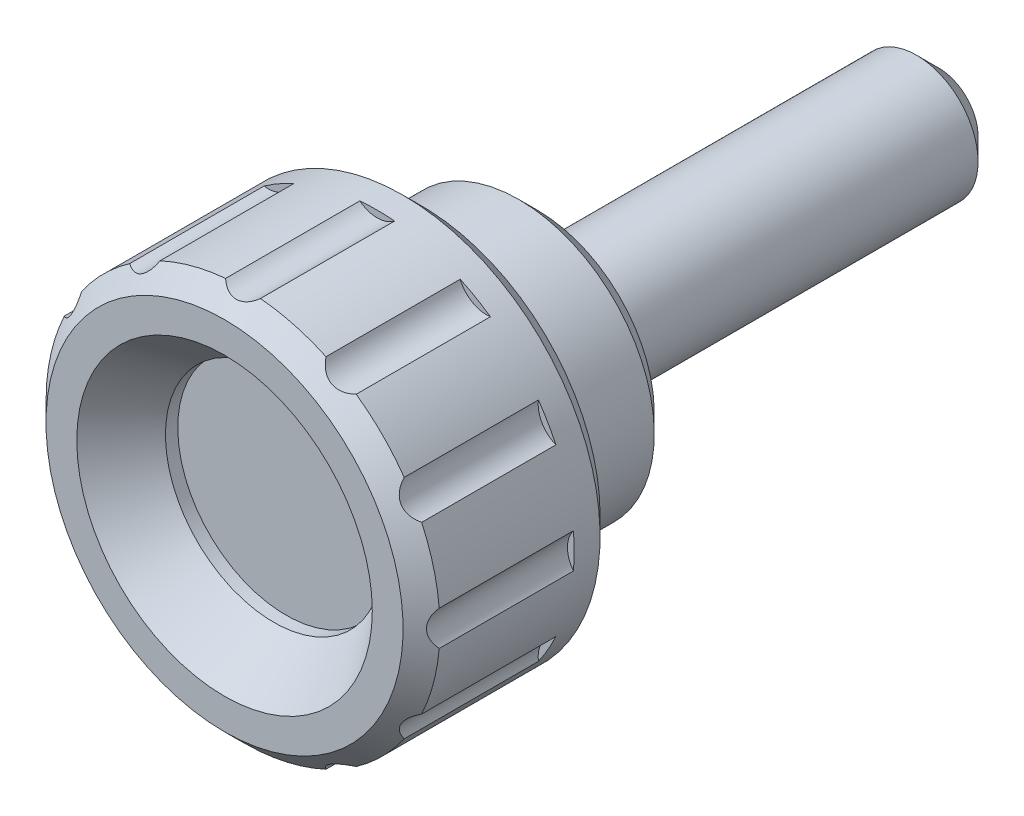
ISO-10303-21;
HEADER;
FILE_DESCRIPTION(('STEP AP214'),'2;1');
FILE_NAME('part.step','',(''),(''),'','','');
FILE_SCHEMA(('AUTOMOTIVE_DESIGN { 1 0 10303 214 1 1 1 1 }'));
ENDSEC;
DATA;
#1=APPLICATION_CONTEXT('core data for automotive mechanical design processes');
#2=APPLICATION_PROTOCOL_DEFINITION('international standard','automotive_design',2000,#1);
#3=PRODUCT_CONTEXT('',#1,'mechanical');
#4=PRODUCT('Part','Part','',(#3));
#5=PRODUCT_RELATED_PRODUCT_CATEGORY('part','',(#4));
#6=PRODUCT_DEFINITION_FORMATION('','',#4);
#7=PRODUCT_DEFINITION_CONTEXT('part definition',#1,'design');
#8=PRODUCT_DEFINITION('design','',#6,#7);
#9=PRODUCT_DEFINITION_SHAPE('','',#8);
#10=(LENGTH_UNIT() NAMED_UNIT(*) SI_UNIT(.MILLI.,.METRE.));
#11=(NAMED_UNIT(*) PLANE_ANGLE_UNIT() SI_UNIT($,.RADIAN.));
#12=(NAMED_UNIT(*) SI_UNIT($,.STERADIAN.) SOLID_ANGLE_UNIT());
#13=UNCERTAINTY_MEASURE_WITH_UNIT(LENGTH_MEASURE(1.E-05),#10,'distance_accuracy_value','');
#14=(GEOMETRIC_REPRESENTATION_CONTEXT(3) GLOBAL_UNCERTAINTY_ASSIGNED_CONTEXT((#13)) GLOBAL_UNIT_ASSIGNED_CONTEXT((#10,
#11,#12)) REPRESENTATION_CONTEXT('',''));
#15=CARTESIAN_POINT('',(0.,0.,0.));
#16=DIRECTION('',(0.,0.,1.));
#17=DIRECTION('',(1.,0.,0.));
#18=AXIS2_PLACEMENT_3D('',#15,#16,#17);
#19=CARTESIAN_POINT('',(3.49999999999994,0.,0.));
#20=DIRECTION('',(0.,0.,-1.));
#21=DIRECTION('',(0.,1.,0.));
#22=AXIS2_PLACEMENT_3D('',#19,#20,#21);
#23=PLANE('',#22);
#24=CARTESIAN_POINT('',(0.,0.,0.));
#25=DIRECTION('',(0.,0.,-1.));
#26=DIRECTION('',(-1.,0.,0.));
#27=AXIS2_PLACEMENT_3D('',#24,#25,#26);
#28=CIRCLE('',#27,3.);
#29=CARTESIAN_POINT('',(-3.,0.,0.));
#30=VERTEX_POINT('',#29);
#31=EDGE_CURVE('E195',#30,#30,#28,.F.);
#32=ORIENTED_EDGE('',*,*,#31,.F.);
#33=EDGE_LOOP('',(#32));
#34=FACE_BOUND('',#33,.T.);
#35=CARTESIAN_POINT('',(0.,0.,0.));
#36=DIRECTION('',(0.,0.,-1.));
#37=DIRECTION('',(-1.,0.,0.));
#38=AXIS2_PLACEMENT_3D('',#35,#36,#37);
#39=CIRCLE('',#38,2.5);
#40=CARTESIAN_POINT('',(-2.5,0.,0.));
#41=VERTEX_POINT('',#40);
#42=EDGE_CURVE('E462',#41,#41,#39,.T.);
#43=ORIENTED_EDGE('',*,*,#42,.F.);
#44=EDGE_LOOP('',(#43));
#45=FACE_BOUND('',#44,.T.);
#46=ADVANCED_FACE('F14',(#34,#45),#23,.T.);
#47=CARTESIAN_POINT('',(4.74999999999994,0.,0.300000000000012));
#48=DIRECTION('',(0.,0.,-1.));
#49=DIRECTION('',(0.,1.,0.));
#50=AXIS2_PLACEMENT_3D('',#47,#48,#49);
#51=PLANE('',#50);
#52=CARTESIAN_POINT('',(0.,0.,0.300000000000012));
#53=DIRECTION('',(0.,0.,-1.));
#54=DIRECTION('',(0.,1.,0.));
#55=AXIS2_PLACEMENT_3D('',#52,#53,#54);
#56=CIRCLE('',#55,4.74999999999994);
#57=CARTESIAN_POINT('',(0.,4.74999999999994,0.300000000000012));
#58=VERTEX_POINT('',#57);
#59=EDGE_CURVE('E348',#58,#58,#56,.T.);
#60=ORIENTED_EDGE('',*,*,#59,.T.);
#61=EDGE_LOOP('',(#60));
#62=FACE_BOUND('',#61,.T.);
#63=CARTESIAN_POINT('',(0.,0.,0.300000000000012));
#64=DIRECTION('',(0.,0.,-1.));
#65=DIRECTION('',(-1.,0.,0.));
#66=AXIS2_PLACEMENT_3D('',#63,#64,#65);
#67=CIRCLE('',#66,3.);
#68=CARTESIAN_POINT('',(-3.,0.,0.300000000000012));
#69=VERTEX_POINT('',#68);
#70=EDGE_CURVE('E442',#69,#69,#67,.T.);
#71=ORIENTED_EDGE('',*,*,#70,.F.);
#72=EDGE_LOOP('',(#71));
#73=FACE_BOUND('',#72,.T.);
#74=ADVANCED_FACE('F400',(#62,#73),#51,.T.);
#75=CARTESIAN_POINT('',(0.,0.,0.300000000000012));
#76=DIRECTION('',(0.,0.,1.));
#77=DIRECTION('',(0.,-1.,0.));
#78=AXIS2_PLACEMENT_3D('',#75,#76,#77);
#79=CONICAL_SURFACE('',#78,4.74999999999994,0.785398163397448);
#80=CARTESIAN_POINT('',(0.,0.,1.05000000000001));
#81=DIRECTION('',(0.,0.,-1.));
#82=DIRECTION('',(0.,1.,0.));
#83=AXIS2_PLACEMENT_3D('',#80,#81,#82);
#84=CIRCLE('',#83,5.49999999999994);
#85=CARTESIAN_POINT('',(0.,5.49999999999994,1.05000000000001));
#86=VERTEX_POINT('',#85);
#87=EDGE_CURVE('E344',#86,#86,#84,.T.);
#88=ORIENTED_EDGE('',*,*,#87,.T.);
#89=EDGE_LOOP('',(#88));
#90=FACE_BOUND('',#89,.T.);
#91=ORIENTED_EDGE('',*,*,#59,.F.);
#92=EDGE_LOOP('',(#91));
#93=FACE_BOUND('',#92,.T.);
#94=ADVANCED_FACE('F407',(#90,#93),#79,.T.);
#95=CARTESIAN_POINT('',(0.,0.,0.));
#96=DIRECTION('',(0.,0.,-1.));
#97=DIRECTION('',(0.,1.,0.));
#98=AXIS2_PLACEMENT_3D('',#95,#96,#97);
#99=CYLINDRICAL_SURFACE('',#98,5.49999999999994);
#100=CARTESIAN_POINT('',(0.,0.,5.));
#101=DIRECTION('',(0.,0.,-1.));
#102=DIRECTION('',(-1.,0.,0.));
#103=AXIS2_PLACEMENT_3D('',#100,#101,#102);
#104=CIRCLE('',#103,5.49999999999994);
#105=CARTESIAN_POINT('',(-5.49999999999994,0.,5.));
#106=VERTEX_POINT('',#105);
#107=EDGE_CURVE('E211',#106,#106,#104,.F.);
#108=ORIENTED_EDGE('',*,*,#107,.F.);
#109=EDGE_LOOP('',(#108));
#110=FACE_BOUND('',#109,.T.);
#111=ORIENTED_EDGE('',*,*,#87,.F.);
#112=EDGE_LOOP('',(#111));
#113=FACE_BOUND('',#112,.T.);
#114=ADVANCED_FACE('F475',(#110,#113),#99,.T.);
#115=CARTESIAN_POINT('',(0.,8.,5.));
#116=DIRECTION('',(0.,0.,-1.));
#117=DIRECTION('',(-1.,0.,0.));
#118=AXIS2_PLACEMENT_3D('',#115,#116,#117);
#119=PLANE('',#118);
#120=CARTESIAN_POINT('',(0.,0.,5.));
#121=DIRECTION('',(0.,0.,-1.));
#122=DIRECTION('',(-1.,0.,0.));
#123=AXIS2_PLACEMENT_3D('',#120,#121,#122);
#124=CIRCLE('',#123,7.25);
#125=CARTESIAN_POINT('',(-7.25,0.,5.));
#126=VERTEX_POINT('',#125);
#127=EDGE_CURVE('E216',#126,#126,#124,.T.);
#128=ORIENTED_EDGE('',*,*,#127,.T.);
#129=EDGE_LOOP('',(#128));
#130=FACE_BOUND('',#129,.T.);
#131=ORIENTED_EDGE('',*,*,#107,.T.);
#132=EDGE_LOOP('',(#131));
#133=FACE_BOUND('',#132,.T.);
#134=ADVANCED_FACE('F415',(#130,#133),#119,.T.);
#135=CARTESIAN_POINT('',(4.4,0.,10.5000000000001));
#136=DIRECTION('',(0.,0.,1.));
#137=DIRECTION('',(0.,-1.,0.));
#138=AXIS2_PLACEMENT_3D('',#135,#136,#137);
#139=PLANE('',#138);
#140=CARTESIAN_POINT('',(0.,0.,10.5000000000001));
#141=DIRECTION('',(0.,0.,-1.));
#142=DIRECTION('',(0.,1.,0.));
#143=AXIS2_PLACEMENT_3D('',#140,#141,#142);
#144=CIRCLE('',#143,4.4);
#145=CARTESIAN_POINT('',(0.,4.4,10.5000000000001));
#146=VERTEX_POINT('',#145);
#147=EDGE_CURVE('E288',#146,#146,#144,.T.);
#148=ORIENTED_EDGE('',*,*,#147,.F.);
#149=EDGE_LOOP('',(#148));
#150=FACE_BOUND('',#149,.T.);
#151=ADVANCED_FACE('F388',(#150),#139,.T.);
#152=CARTESIAN_POINT('',(0.,0.,0.));
#153=DIRECTION('',(0.,0.,-1.));
#154=DIRECTION('',(0.,1.,0.));
#155=AXIS2_PLACEMENT_3D('',#152,#153,#154);
#156=CYLINDRICAL_SURFACE('',#155,4.4);
#157=ORIENTED_EDGE('',*,*,#147,.T.);
#158=EDGE_LOOP('',(#157));
#159=FACE_BOUND('',#158,.T.);
#160=CARTESIAN_POINT('',(0.,0.,11.));
#161=DIRECTION('',(0.,0.,-1.));
#162=DIRECTION('',(0.,1.,0.));
#163=AXIS2_PLACEMENT_3D('',#160,#161,#162);
#164=CIRCLE('',#163,4.4);
#165=CARTESIAN_POINT('',(0.,4.4,11.));
#166=VERTEX_POINT('',#165);
#167=EDGE_CURVE('E332',#166,#166,#164,.T.);
#168=ORIENTED_EDGE('',*,*,#167,.F.);
#169=EDGE_LOOP('',(#168));
#170=FACE_BOUND('',#169,.T.);
#171=ADVANCED_FACE('F384',(#159,#170),#156,.F.);
#172=CARTESIAN_POINT('',(0.,0.,13.));
#173=DIRECTION('',(0.,0.,1.));
#174=DIRECTION('',(0.,-1.,0.));
#175=AXIS2_PLACEMENT_3D('',#172,#173,#174);
#176=CONICAL_SURFACE('',#175,6.,0.67474094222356);
#177=ORIENTED_EDGE('',*,*,#167,.T.);
#178=EDGE_LOOP('',(#177));
#179=FACE_BOUND('',#178,.T.);
#180=CARTESIAN_POINT('',(0.,0.,13.));
#181=DIRECTION('',(0.,0.,-1.));
#182=DIRECTION('',(0.,1.,0.));
#183=AXIS2_PLACEMENT_3D('',#180,#181,#182);
#184=CIRCLE('',#183,6.);
#185=CARTESIAN_POINT('',(0.,6.,13.));
#186=VERTEX_POINT('',#185);
#187=EDGE_CURVE('E335',#186,#186,#184,.T.);
#188=ORIENTED_EDGE('',*,*,#187,.F.);
#189=EDGE_LOOP('',(#188));
#190=FACE_BOUND('',#189,.T.);
#191=ADVANCED_FACE('F387',(#179,#190),#176,.F.);
#192=CARTESIAN_POINT('',(6.,0.,13.));
#193=DIRECTION('',(0.,0.,1.));
#194=DIRECTION('',(0.,-1.,0.));
#195=AXIS2_PLACEMENT_3D('',#192,#193,#194);
#196=PLANE('',#195);
#197=ORIENTED_EDGE('',*,*,#187,.T.);
#198=EDGE_LOOP('',(#197));
#199=FACE_BOUND('',#198,.T.);
#200=CARTESIAN_POINT('',(0.,0.,13.));
#201=DIRECTION('',(0.,0.,-1.));
#202=DIRECTION('',(0.,1.,0.));
#203=AXIS2_PLACEMENT_3D('',#200,#201,#202);
#204=CIRCLE('',#203,7.25);
#205=CARTESIAN_POINT('',(0.,7.25,13.));
#206=VERTEX_POINT('',#205);
#207=EDGE_CURVE('E338',#206,#206,#204,.T.);
#208=ORIENTED_EDGE('',*,*,#207,.F.);
#209=EDGE_LOOP('',(#208));
#210=FACE_BOUND('',#209,.T.);
#211=ADVANCED_FACE('F380',(#199,#210),#196,.T.);
#212=CARTESIAN_POINT('',(0.,0.,6.8));
#213=DIRECTION('',(0.,0.,1.));
#214=DIRECTION('',(0.,-1.,0.));
#215=AXIS2_PLACEMENT_3D('',#212,#213,#214);
#216=PLANE('',#215);
#217=CARTESIAN_POINT('',(-1.2490009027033E-13,-8.87500000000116,6.8));
#218=DIRECTION('',(0.,0.,-1.));
#219=DIRECTION('',(0.,-1.,0.));
#220=AXIS2_PLACEMENT_3D('',#217,#218,#219);
#221=CIRCLE('',#220,1.15);
#222=CARTESIAN_POINT('',(-0.707804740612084,-7.96862676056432,6.8));
#223=VERTEX_POINT('',#222);
#224=CARTESIAN_POINT('',(0.70780474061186,-7.96862676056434,6.8));
#225=VERTEX_POINT('',#224);
#226=EDGE_CURVE('E275',#223,#225,#221,.T.);
#227=ORIENTED_EDGE('',*,*,#226,.F.);
#228=CARTESIAN_POINT('',(0.,0.,6.8));
#229=DIRECTION('',(0.,0.,1.));
#230=DIRECTION('',(0.,-1.,0.));
#231=AXIS2_PLACEMENT_3D('',#228,#229,#230);
#232=CIRCLE('',#231,8.);
#233=EDGE_CURVE('E222',#225,#223,#232,.F.);
#234=ORIENTED_EDGE('',*,*,#233,.F.);
#235=EDGE_LOOP('',(#227,#234));
#236=FACE_BOUND('',#235,.T.);
#237=ADVANCED_FACE('F376',(#236),#216,.T.);
#238=CARTESIAN_POINT('',(-1.2490009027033E-13,-8.87500000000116,6.8));
#239=DIRECTION('',(0.,0.,1.));
#240=DIRECTION('',(0.,-1.,0.));
#241=AXIS2_PLACEMENT_3D('',#238,#239,#240);
#242=CYLINDRICAL_SURFACE('',#241,1.15);
#243=DIRECTION('',(0.,0.,1.));
#244=VECTOR('',#243,1.);
#245=CARTESIAN_POINT('',(-0.707804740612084,-7.96862676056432,6.8));
#246=LINE('',#245,#244);
#247=CARTESIAN_POINT('',(-0.707804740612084,-7.96862676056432,12.2499999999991));
#248=VERTEX_POINT('',#247);
#249=EDGE_CURVE('E301',#223,#248,#246,.T.);
#250=ORIENTED_EDGE('',*,*,#249,.F.);
#251=ORIENTED_EDGE('',*,*,#226,.T.);
#252=DIRECTION('',(0.,0.,1.));
#253=VECTOR('',#252,1.);
#254=CARTESIAN_POINT('',(0.70780474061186,-7.96862676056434,6.8));
#255=LINE('',#254,#253);
#256=CARTESIAN_POINT('',(0.707804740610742,-7.96862676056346,12.25));
#257=VERTEX_POINT('',#256);
#258=EDGE_CURVE('E299',#225,#257,#255,.T.);
#259=ORIENTED_EDGE('',*,*,#258,.T.);
#260=CARTESIAN_POINT('',(-0.708004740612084,-7.96878298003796,12.2498266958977));
#261=CARTESIAN_POINT('',(-0.670016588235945,-7.93910304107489,12.2827435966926));
#262=CARTESIAN_POINT('',(-0.629096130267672,-7.91098728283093,12.3141461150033));
#263=CARTESIAN_POINT('',(-0.541113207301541,-7.85895957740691,12.3725489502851));
#264=CARTESIAN_POINT('',(-0.493993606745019,-7.83509230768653,12.3995022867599));
#265=CARTESIAN_POINT('',(-0.403110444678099,-7.79705455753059,12.4426329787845));
#266=CARTESIAN_POINT('',(-0.360275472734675,-7.7819114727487,12.4598771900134));
#267=CARTESIAN_POINT('',(-0.271519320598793,-7.75656520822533,12.4888070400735));
#268=CARTESIAN_POINT('',(-0.225610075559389,-7.74634405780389,12.5005128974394));
#269=CARTESIAN_POINT('',(-0.131281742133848,-7.73151414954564,12.5175147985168));
#270=CARTESIAN_POINT('',(-0.0828445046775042,-7.72695427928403,12.522755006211));
#271=CARTESIAN_POINT('',(0.014487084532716,-7.72406175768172,12.5260777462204));
#272=CARTESIAN_POINT('',(0.0633815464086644,-7.72573064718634,12.5241585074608));
#273=CARTESIAN_POINT('',(0.154026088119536,-7.73456075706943,12.5140225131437));
#274=CARTESIAN_POINT('',(0.195934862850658,-7.74104594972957,12.5065809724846));
#275=CARTESIAN_POINT('',(0.277692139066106,-7.7582480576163,12.4868901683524));
#276=CARTESIAN_POINT('',(0.31753961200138,-7.76896706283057,12.4746385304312));
#277=CARTESIAN_POINT('',(0.408286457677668,-7.79851491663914,12.440973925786));
#278=CARTESIAN_POINT('',(0.458050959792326,-7.8188729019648,12.4178517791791));
#279=CARTESIAN_POINT('',(0.551931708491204,-7.86474498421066,12.3660439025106));
#280=CARTESIAN_POINT('',(0.596041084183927,-7.89026525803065,12.3373515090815));
#281=CARTESIAN_POINT('',(0.661880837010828,-7.93410696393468,12.2883657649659));
#282=CARTESIAN_POINT('',(0.685443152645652,-7.95116148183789,12.2693731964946));
#283=CARTESIAN_POINT('',(0.708004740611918,-7.96878298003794,12.2498266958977));
#284=B_SPLINE_CURVE_WITH_KNOTS('',3,(#260,#261,#262,#263,#264,#265,#266,#267,#268,#269,#270,
#271,#272,#273,#274,#275,#276,#277,#278,#279,#280,#281,#282,#283),.UNSPECIFIED.,.F.,.F.,(4,2,2,
2,2,2,2,2,2,2,2,4),(0.,0.17542065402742,0.352589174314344,0.497789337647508,0.642455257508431,
0.78836193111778,0.934304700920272,1.06290984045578,1.19157854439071,1.36619586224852,
1.54102336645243,1.64509140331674),.UNSPECIFIED.);
#285=EDGE_CURVE('E503',#248,#257,#284,.T.);
#286=ORIENTED_EDGE('',*,*,#285,.F.);
#287=EDGE_LOOP('',(#250,#251,#259,#286));
#288=FACE_BOUND('',#287,.T.);
#289=ADVANCED_FACE('F379',(#288),#242,.F.);
#290=CARTESIAN_POINT('',(4.43750000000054,-7.68597545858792,6.8));
#291=DIRECTION('',(0.,0.,-1.));
#292=DIRECTION('',(0.,-1.,0.));
#293=AXIS2_PLACEMENT_3D('',#290,#291,#292);
#294=CIRCLE('',#293,1.15);
#295=CARTESIAN_POINT('',(3.37133649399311,-7.25493557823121,6.8));
#296=VERTEX_POINT('',#295);
#297=CARTESIAN_POINT('',(4.59729026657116,-6.54713083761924,6.8));
#298=VERTEX_POINT('',#297);
#299=EDGE_CURVE('E278',#296,#298,#294,.T.);
#300=ORIENTED_EDGE('',*,*,#299,.F.);
#301=EDGE_CURVE('E218',#298,#296,#232,.F.);
#302=ORIENTED_EDGE('',*,*,#301,.F.);
#303=EDGE_LOOP('',(#300,#302));
#304=FACE_BOUND('',#303,.T.);
#305=ADVANCED_FACE('F383',(#304),#216,.T.);
#306=CARTESIAN_POINT('',(4.43750000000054,-7.68597545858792,6.8));
#307=DIRECTION('',(0.,0.,1.));
#308=DIRECTION('',(0.,-1.,0.));
#309=AXIS2_PLACEMENT_3D('',#306,#307,#308);
#310=CYLINDRICAL_SURFACE('',#309,1.15);
#311=DIRECTION('',(0.,0.,1.));
#312=VECTOR('',#311,1.);
#313=CARTESIAN_POINT('',(3.37133649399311,-7.25493557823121,6.8));
#314=LINE('',#313,#312);
#315=CARTESIAN_POINT('',(3.37133649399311,-7.25493557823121,12.2499999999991));
#316=VERTEX_POINT('',#315);
#317=EDGE_CURVE('E297',#296,#316,#314,.T.);
#318=ORIENTED_EDGE('',*,*,#317,.F.);
#319=ORIENTED_EDGE('',*,*,#299,.T.);
#320=DIRECTION('',(0.,0.,1.));
#321=VECTOR('',#320,1.);
#322=CARTESIAN_POINT('',(4.59729026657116,-6.54713083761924,6.8));
#323=LINE('',#322,#321);
#324=CARTESIAN_POINT('',(4.59729026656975,-6.54713083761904,12.25));
#325=VERTEX_POINT('',#324);
#326=EDGE_CURVE('E295',#298,#325,#323,.T.);
#327=ORIENTED_EDGE('',*,*,#326,.T.);
#328=CARTESIAN_POINT('',(3.37125565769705,-7.25513557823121,12.2498526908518));
#329=CARTESIAN_POINT('',(3.38931533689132,-7.2104398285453,12.2827673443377));
#330=CARTESIAN_POINT('',(3.41069638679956,-7.16563264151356,12.3141675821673));
#331=CARTESIAN_POINT('',(3.46087905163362,-7.07658806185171,12.3725658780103));
#332=CARTESIAN_POINT('',(3.48975247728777,-7.032360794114,12.399516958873));
#333=CARTESIAN_POINT('',(3.54944136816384,-6.95398075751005,12.4426442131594));
#334=CARTESIAN_POINT('',(3.57896658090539,-6.91945000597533,12.459887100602));
#335=CARTESIAN_POINT('',(3.64315945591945,-6.85312362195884,12.4888142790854));
#336=CARTESIAN_POINT('',(3.67780779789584,-6.82131839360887,12.5005187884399));
#337=CARTESIAN_POINT('',(3.75208390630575,-6.76131362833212,12.5175180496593));
#338=CARTESIAN_POINT('',(3.79175182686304,-6.73314735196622,12.5227569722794));
#339=CARTESIAN_POINT('',(3.87459677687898,-6.68197914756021,12.5260773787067));
#340=CARTESIAN_POINT('',(3.91777467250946,-6.65897849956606,12.5241570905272));
#341=CARTESIAN_POINT('',(4.00068974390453,-6.62130533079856,12.5140193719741));
#342=CARTESIAN_POINT('',(4.04022639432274,-6.60596809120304,12.5065770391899));
#343=CARTESIAN_POINT('',(4.1196311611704,-6.57998847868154,12.4868847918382));
#344=CARTESIAN_POINT('',(4.15949943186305,-6.56934843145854,12.4746325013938));
#345=CARTESIAN_POINT('',(4.25286326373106,-6.54956561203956,12.4409660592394));
#346=CARTESIAN_POINT('',(4.30614049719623,-6.54231471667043,12.4178426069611));
#347=CARTESIAN_POINT('',(4.41038121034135,-6.53510255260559,12.3660321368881));
#348=CARTESIAN_POINT('',(4.46134183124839,-6.53515005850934,12.3373384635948));
#349=CARTESIAN_POINT('',(4.54025639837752,-6.54019818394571,12.2883669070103));
#350=CARTESIAN_POINT('',(4.56916440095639,-6.54318368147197,12.269391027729));
#351=CARTESIAN_POINT('',(4.59749026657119,-6.5471589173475,12.2498620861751));
#352=B_SPLINE_CURVE_WITH_KNOTS('',3,(#328,#329,#330,#331,#332,#333,#334,#335,#336,#337,#338,
#339,#340,#341,#342,#343,#344,#345,#346,#347,#348,#349,#350,#351),.UNSPECIFIED.,.F.,.F.,(4,2,2,
2,2,2,2,2,2,2,2,4),(0.,0.175413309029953,0.352574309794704,0.497771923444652,0.64243531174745,
0.788339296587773,0.934279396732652,1.06288407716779,1.19155236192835,1.36617341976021,
1.54100441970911,1.64498267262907),.UNSPECIFIED.);
#353=EDGE_CURVE('E496',#316,#325,#352,.T.);
#354=ORIENTED_EDGE('',*,*,#353,.F.);
#355=EDGE_LOOP('',(#318,#319,#327,#354));
#356=FACE_BOUND('',#355,.T.);
#357=ADVANCED_FACE('F510',(#356),#310,.F.);
#358=CARTESIAN_POINT('',(7.68597545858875,-4.43749999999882,6.8));
#359=DIRECTION('',(0.,0.,-1.));
#360=DIRECTION('',(0.,-1.,0.));
#361=AXIS2_PLACEMENT_3D('',#358,#359,#360);
#362=CIRCLE('',#361,1.15000000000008);
#363=CARTESIAN_POINT('',(6.54713083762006,-4.59729026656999,6.8));
#364=VERTEX_POINT('',#363);
#365=CARTESIAN_POINT('',(7.25493557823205,-3.37133649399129,6.8));
#366=VERTEX_POINT('',#365);
#367=EDGE_CURVE('E281',#364,#366,#362,.T.);
#368=ORIENTED_EDGE('',*,*,#367,.F.);
#369=EDGE_CURVE('E212',#366,#364,#232,.F.);
#370=ORIENTED_EDGE('',*,*,#369,.F.);
#371=EDGE_LOOP('',(#368,#370));
#372=FACE_BOUND('',#371,.T.);
#373=ADVANCED_FACE('F513',(#372),#216,.T.);
#374=CARTESIAN_POINT('',(7.68597545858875,-4.43749999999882,6.8));
#375=DIRECTION('',(0.,0.,1.));
#376=DIRECTION('',(0.,-1.,0.));
#377=AXIS2_PLACEMENT_3D('',#374,#375,#376);
#378=CYLINDRICAL_SURFACE('',#377,1.15000000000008);
#379=DIRECTION('',(0.,0.,1.));
#380=VECTOR('',#379,1.);
#381=CARTESIAN_POINT('',(6.54713083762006,-4.59729026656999,6.8));
#382=LINE('',#381,#380);
#383=CARTESIAN_POINT('',(6.54713083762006,-4.59729026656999,12.2499999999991));
#384=VERTEX_POINT('',#383);
#385=EDGE_CURVE('E293',#364,#384,#382,.T.);
#386=ORIENTED_EDGE('',*,*,#385,.F.);
#387=ORIENTED_EDGE('',*,*,#367,.T.);
#388=DIRECTION('',(0.,0.,1.));
#389=VECTOR('',#388,1.);
#390=CARTESIAN_POINT('',(7.25493557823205,-3.37133649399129,6.8));
#391=LINE('',#390,#389);
#392=CARTESIAN_POINT('',(7.25493557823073,-3.37133649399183,12.25));
#393=VERTEX_POINT('',#392);
#394=EDGE_CURVE('E291',#366,#393,#391,.T.);
#395=ORIENTED_EDGE('',*,*,#394,.T.);
#396=CARTESIAN_POINT('',(6.54715891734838,-4.59749026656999,12.249862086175));
#397=CARTESIAN_POINT('',(6.54045182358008,-4.54975319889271,12.2827759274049));
#398=CARTESIAN_POINT('',(6.53656536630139,-4.50025899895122,12.3141753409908));
#399=CARTESIAN_POINT('',(6.53550363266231,-4.39805391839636,12.3725719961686));
#400=CARTESIAN_POINT('',(6.53839560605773,-4.34531590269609,12.3995222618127));
#401=CARTESIAN_POINT('',(6.55089846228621,-4.24759324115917,12.4426482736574));
#402=CARTESIAN_POINT('',(6.55920303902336,-4.20292634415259,12.4598906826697));
#403=CARTESIAN_POINT('',(6.58163319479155,-4.11339009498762,12.4888168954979));
#404=CARTESIAN_POINT('',(6.59573724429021,-4.06852209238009,12.5005209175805));
#405=CARTESIAN_POINT('',(6.63006040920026,-3.97941910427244,12.5175192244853));
#406=CARTESIAN_POINT('',(6.65033092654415,-3.93519284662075,12.5227576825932));
#407=CARTESIAN_POINT('',(6.69649299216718,-3.84945829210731,12.5260772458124));
#408=CARTESIAN_POINT('',(6.72238593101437,-3.8079506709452,12.5241565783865));
#409=CARTESIAN_POINT('',(6.77535612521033,-3.73386792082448,12.5140182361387));
#410=CARTESIAN_POINT('',(6.80192739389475,-3.70081740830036,12.5065756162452));
#411=CARTESIAN_POINT('',(6.85770436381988,-3.63861654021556,12.486882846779));
#412=CARTESIAN_POINT('',(6.88691136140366,-3.60946812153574,12.4746303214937));
#413=CARTESIAN_POINT('',(6.95787590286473,-3.54565408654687,12.4409632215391));
#414=CARTESIAN_POINT('',(7.00039031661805,-3.51273611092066,12.4178393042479));
#415=CARTESIAN_POINT('',(7.08706015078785,-3.45437012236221,12.3660279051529));
#416=CARTESIAN_POINT('',(7.13121748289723,-3.42893113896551,12.3373337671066));
#417=CARTESIAN_POINT('',(7.20208570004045,-3.39384524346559,12.2883604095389));
#418=CARTESIAN_POINT('',(7.22861528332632,-3.38197627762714,12.2693831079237));
#419=CARTESIAN_POINT('',(7.25513557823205,-3.37125565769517,12.2498526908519));
#420=B_SPLINE_CURVE_WITH_KNOTS('',3,(#396,#397,#398,#399,#400,#401,#402,#403,#404,#405,#406,
#407,#408,#409,#410,#411,#412,#413,#414,#415,#416,#417,#418,#419),.UNSPECIFIED.,.F.,.F.,(4,2,2,
2,2,2,2,2,2,2,2,4),(0.,0.175410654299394,0.352568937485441,0.497765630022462,0.642428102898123,
0.788331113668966,0.934270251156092,1.06287477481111,1.19154289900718,1.36616525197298,
1.54099757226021,1.64498268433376),.UNSPECIFIED.);
#421=EDGE_CURVE('E207',#384,#393,#420,.T.);
#422=ORIENTED_EDGE('',*,*,#421,.F.);
#423=EDGE_LOOP('',(#386,#387,#395,#422));
#424=FACE_BOUND('',#423,.T.);
#425=ADVANCED_FACE('F482',(#424),#378,.F.);
#426=CARTESIAN_POINT('',(8.87500000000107,1.83793952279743E-12,6.8));
#427=DIRECTION('',(0.,0.,-1.));
#428=DIRECTION('',(0.,-1.,0.));
#429=AXIS2_PLACEMENT_3D('',#426,#427,#428);
#430=CIRCLE('',#429,1.15);
#431=CARTESIAN_POINT('',(7.96862676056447,-0.707804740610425,6.8));
#432=VERTEX_POINT('',#431);
#433=CARTESIAN_POINT('',(7.96862676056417,0.707804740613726,6.8));
#434=VERTEX_POINT('',#433);
#435=EDGE_CURVE('E189',#432,#434,#430,.T.);
#436=ORIENTED_EDGE('',*,*,#435,.F.);
#437=EDGE_CURVE('E203',#434,#432,#232,.F.);
#438=ORIENTED_EDGE('',*,*,#437,.F.);
#439=EDGE_LOOP('',(#436,#438));
#440=FACE_BOUND('',#439,.T.);
#441=ADVANCED_FACE('F480',(#440),#216,.T.);
#442=CARTESIAN_POINT('',(8.87500000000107,1.83793952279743E-12,6.8));
#443=DIRECTION('',(0.,0.,1.));
#444=DIRECTION('',(0.,-1.,0.));
#445=AXIS2_PLACEMENT_3D('',#442,#443,#444);
#446=CYLINDRICAL_SURFACE('',#445,1.15);
#447=DIRECTION('',(0.,0.,1.));
#448=VECTOR('',#447,1.);
#449=CARTESIAN_POINT('',(7.96862676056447,-0.707804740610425,6.8));
#450=LINE('',#449,#448);
#451=CARTESIAN_POINT('',(7.96862676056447,-0.707804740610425,12.2499999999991));
#452=VERTEX_POINT('',#451);
#453=EDGE_CURVE('E289',#432,#452,#450,.T.);
#454=ORIENTED_EDGE('',*,*,#453,.F.);
#455=ORIENTED_EDGE('',*,*,#435,.T.);
#456=DIRECTION('',(0.,0.,1.));
#457=VECTOR('',#456,1.);
#458=CARTESIAN_POINT('',(7.96862676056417,0.707804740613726,6.8));
#459=LINE('',#458,#457);
#460=CARTESIAN_POINT('',(7.9686267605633,0.707804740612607,12.25));
#461=VERTEX_POINT('',#460);
#462=EDGE_CURVE('E286',#434,#461,#459,.T.);
#463=ORIENTED_EDGE('',*,*,#462,.T.);
#464=CARTESIAN_POINT('',(7.9687829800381,-0.708004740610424,12.2498266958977));
#465=CARTESIAN_POINT('',(7.93910304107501,-0.670016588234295,12.2827435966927));
#466=CARTESIAN_POINT('',(7.91098728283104,-0.629096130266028,12.3141461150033));
#467=CARTESIAN_POINT('',(7.85895957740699,-0.541113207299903,12.3725489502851));
#468=CARTESIAN_POINT('',(7.83509230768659,-0.49399360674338,12.3995022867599));
#469=CARTESIAN_POINT('',(7.79705455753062,-0.403110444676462,12.4426329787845));
#470=CARTESIAN_POINT('',(7.78191147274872,-0.36027547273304,12.4598771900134));
#471=CARTESIAN_POINT('',(7.75656520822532,-0.271519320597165,12.4888070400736));
#472=CARTESIAN_POINT('',(7.74634405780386,-0.225610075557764,12.5005128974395));
#473=CARTESIAN_POINT('',(7.73151414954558,-0.131281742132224,12.5175147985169));
#474=CARTESIAN_POINT('',(7.72695427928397,-0.0828445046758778,12.5227550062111));
#475=CARTESIAN_POINT('',(7.72406175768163,0.0144870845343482,12.5260777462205));
#476=CARTESIAN_POINT('',(7.72573064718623,0.0633815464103,12.5241585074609));
#477=CARTESIAN_POINT('',(7.7345607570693,0.154026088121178,12.5140225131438));
#478=CARTESIAN_POINT('',(7.74104594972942,0.195934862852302,12.5065809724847));
#479=CARTESIAN_POINT('',(7.75824805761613,0.277692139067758,12.4868901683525));
#480=CARTESIAN_POINT('',(7.76896706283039,0.317539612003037,12.4746385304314));
#481=CARTESIAN_POINT('',(7.79851491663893,0.408286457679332,12.4409739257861));
#482=CARTESIAN_POINT('',(7.81887290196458,0.458050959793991,12.4178517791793));
#483=CARTESIAN_POINT('',(7.86474498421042,0.551931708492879,12.3660439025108));
#484=CARTESIAN_POINT('',(7.89026525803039,0.596041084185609,12.3373515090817));
#485=CARTESIAN_POINT('',(7.93410696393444,0.661880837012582,12.288365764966));
#486=CARTESIAN_POINT('',(7.95116148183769,0.685443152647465,12.2693731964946));
#487=CARTESIAN_POINT('',(7.96878298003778,0.708004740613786,12.2498266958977));
#488=B_SPLINE_CURVE_WITH_KNOTS('',3,(#464,#465,#466,#467,#468,#469,#470,#471,#472,#473,#474,
#475,#476,#477,#478,#479,#480,#481,#482,#483,#484,#485,#486,#487),.UNSPECIFIED.,.F.,.F.,(4,2,2,
2,2,2,2,2,2,2,2,4),(0.,0.175420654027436,0.352589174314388,0.497789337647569,0.642455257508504,
0.788361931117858,0.934304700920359,1.06290984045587,1.19157854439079,1.36619586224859,
1.5410233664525,1.64509140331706),.UNSPECIFIED.);
#489=EDGE_CURVE('E201',#452,#461,#488,.T.);
#490=ORIENTED_EDGE('',*,*,#489,.F.);
#491=EDGE_LOOP('',(#454,#455,#463,#490));
#492=FACE_BOUND('',#491,.T.);
#493=ADVANCED_FACE('F476',(#492),#446,.F.);
#494=CARTESIAN_POINT('',(7.68597545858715,4.43750000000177,6.8));
#495=DIRECTION('',(0.,0.,-1.));
#496=DIRECTION('',(0.,-1.,0.));
#497=AXIS2_PLACEMENT_3D('',#494,#495,#496);
#498=CIRCLE('',#497,1.15);
#499=CARTESIAN_POINT('',(7.25493557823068,3.37133649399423,6.8));
#500=VERTEX_POINT('',#499);
#501=CARTESIAN_POINT('',(6.54713083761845,4.59729026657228,6.8));
#502=VERTEX_POINT('',#501);
#503=EDGE_CURVE('E180',#500,#502,#498,.T.);
#504=ORIENTED_EDGE('',*,*,#503,.F.);
#505=EDGE_CURVE('E193',#502,#500,#232,.F.);
#506=ORIENTED_EDGE('',*,*,#505,.F.);
#507=EDGE_LOOP('',(#504,#506));
#508=FACE_BOUND('',#507,.T.);
#509=ADVANCED_FACE('F192',(#508),#216,.T.);
#510=CARTESIAN_POINT('',(7.68597545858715,4.43750000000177,6.8));
#511=DIRECTION('',(0.,0.,1.));
#512=DIRECTION('',(0.,-1.,0.));
#513=AXIS2_PLACEMENT_3D('',#510,#511,#512);
#514=CYLINDRICAL_SURFACE('',#513,1.15);
#515=DIRECTION('',(0.,0.,1.));
#516=VECTOR('',#515,1.);
#517=CARTESIAN_POINT('',(7.25493557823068,3.37133649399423,6.8));
#518=LINE('',#517,#516);
#519=CARTESIAN_POINT('',(7.25493557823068,3.37133649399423,12.2499999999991));
#520=VERTEX_POINT('',#519);
#521=EDGE_CURVE('E177',#500,#520,#518,.T.);
#522=ORIENTED_EDGE('',*,*,#521,.F.);
#523=ORIENTED_EDGE('',*,*,#503,.T.);
#524=DIRECTION('',(0.,0.,1.));
#525=VECTOR('',#524,1.);
#526=CARTESIAN_POINT('',(6.54713083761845,4.59729026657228,6.8));
#527=LINE('',#526,#525);
#528=CARTESIAN_POINT('',(6.54713083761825,4.59729026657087,12.25));
#529=VERTEX_POINT('',#528);
#530=EDGE_CURVE('E188',#502,#529,#527,.T.);
#531=ORIENTED_EDGE('',*,*,#530,.T.);
#532=CARTESIAN_POINT('',(7.25513557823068,3.37125565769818,12.2498526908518));
#533=CARTESIAN_POINT('',(7.21043982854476,3.38931533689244,12.2827673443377));
#534=CARTESIAN_POINT('',(7.16563264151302,3.41069638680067,12.3141675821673));
#535=CARTESIAN_POINT('',(7.07658806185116,3.46087905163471,12.3725658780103));
#536=CARTESIAN_POINT('',(7.03236079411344,3.48975247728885,12.399516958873));
#537=CARTESIAN_POINT('',(6.95398075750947,3.5494413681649,12.4426442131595));
#538=CARTESIAN_POINT('',(6.91945000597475,3.57896658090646,12.459887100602));
#539=CARTESIAN_POINT('',(6.85312362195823,3.6431594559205,12.4888142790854));
#540=CARTESIAN_POINT('',(6.82131839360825,3.67780779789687,12.50051878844));
#541=CARTESIAN_POINT('',(6.76131362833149,3.75208390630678,12.5175180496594));
#542=CARTESIAN_POINT('',(6.73314735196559,3.79175182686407,12.5227569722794));
#543=CARTESIAN_POINT('',(6.68197914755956,3.87459677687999,12.5260773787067));
#544=CARTESIAN_POINT('',(6.6589784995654,3.91777467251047,12.5241570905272));
#545=CARTESIAN_POINT('',(6.62130533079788,4.00068974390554,12.5140193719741));
#546=CARTESIAN_POINT('',(6.60596809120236,4.04022639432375,12.50657703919));
#547=CARTESIAN_POINT('',(6.57998847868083,4.1196311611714,12.4868847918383));
#548=CARTESIAN_POINT('',(6.56934843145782,4.15949943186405,12.4746325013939));
#549=CARTESIAN_POINT('',(6.54956561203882,4.25286326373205,12.4409660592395));
#550=CARTESIAN_POINT('',(6.54231471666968,4.30614049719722,12.4178426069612));
#551=CARTESIAN_POINT('',(6.53510255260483,4.41038121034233,12.3660321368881));
#552=CARTESIAN_POINT('',(6.53515005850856,4.46134183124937,12.3373384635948));
#553=CARTESIAN_POINT('',(6.54019818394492,4.54025639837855,12.2883669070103));
#554=CARTESIAN_POINT('',(6.54318368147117,4.56916440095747,12.269391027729));
#555=CARTESIAN_POINT('',(6.54715891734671,4.59749026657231,12.2498620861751));
#556=B_SPLINE_CURVE_WITH_KNOTS('',3,(#532,#533,#534,#535,#536,#537,#538,#539,#540,#541,#542,
#543,#544,#545,#546,#547,#548,#549,#550,#551,#552,#553,#554,#555),.UNSPECIFIED.,.F.,.F.,(4,2,2,
2,2,2,2,2,2,2,2,4),(0.,0.175413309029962,0.352574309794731,0.497771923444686,0.642435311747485,
0.788339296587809,0.934279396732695,1.06288407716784,1.1915523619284,1.36617341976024,
1.54100441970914,1.64498267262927),.UNSPECIFIED.);
#557=EDGE_CURVE('E183',#520,#529,#556,.T.);
#558=ORIENTED_EDGE('',*,*,#557,.F.);
#559=EDGE_LOOP('',(#522,#523,#531,#558));
#560=FACE_BOUND('',#559,.T.);
#561=ADVANCED_FACE('F179',(#560),#514,.F.);
#562=CARTESIAN_POINT('',(4.43750000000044,7.68597545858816,6.8));
#563=DIRECTION('',(0.,0.,-1.));
#564=DIRECTION('',(0.,-1.,0.));
#565=AXIS2_PLACEMENT_3D('',#562,#563,#564);
#566=CIRCLE('',#565,1.15);
#567=CARTESIAN_POINT('',(4.59729026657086,6.54713083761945,6.8));
#568=VERTEX_POINT('',#567);
#569=CARTESIAN_POINT('',(3.3713364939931,7.25493557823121,6.8));
#570=VERTEX_POINT('',#569);
#571=EDGE_CURVE('E194',#568,#570,#566,.T.);
#572=ORIENTED_EDGE('',*,*,#571,.F.);
#573=EDGE_CURVE('E200',#570,#568,#232,.F.);
#574=ORIENTED_EDGE('',*,*,#573,.F.);
#575=EDGE_LOOP('',(#572,#574));
#576=FACE_BOUND('',#575,.T.);
#577=ADVANCED_FACE('F372',(#576),#216,.T.);
#578=CARTESIAN_POINT('',(4.43750000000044,7.68597545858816,6.8));
#579=DIRECTION('',(0.,0.,1.));
#580=DIRECTION('',(0.,-1.,0.));
#581=AXIS2_PLACEMENT_3D('',#578,#579,#580);
#582=CYLINDRICAL_SURFACE('',#581,1.15);
#583=DIRECTION('',(0.,0.,1.));
#584=VECTOR('',#583,1.);
#585=CARTESIAN_POINT('',(4.59729026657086,6.54713083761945,6.8));
#586=LINE('',#585,#584);
#587=CARTESIAN_POINT('',(4.59729026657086,6.54713083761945,12.2499999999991));
#588=VERTEX_POINT('',#587);
#589=EDGE_CURVE('E326',#568,#588,#586,.T.);
#590=ORIENTED_EDGE('',*,*,#589,.F.);
#591=ORIENTED_EDGE('',*,*,#571,.T.);
#592=DIRECTION('',(0.,0.,1.));
#593=VECTOR('',#592,1.);
#594=CARTESIAN_POINT('',(3.3713364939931,7.25493557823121,6.8));
#595=LINE('',#594,#593);
#596=CARTESIAN_POINT('',(3.37133649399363,7.25493557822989,12.25));
#597=VERTEX_POINT('',#596);
#598=EDGE_CURVE('E324',#570,#597,#595,.T.);
#599=ORIENTED_EDGE('',*,*,#598,.T.);
#600=CARTESIAN_POINT('',(4.59749026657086,6.54715891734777,12.249862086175));
#601=CARTESIAN_POINT('',(4.5497531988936,6.5404518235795,12.2827759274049));
#602=CARTESIAN_POINT('',(4.50025899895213,6.53656536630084,12.3141753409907));
#603=CARTESIAN_POINT('',(4.39805391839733,6.53550363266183,12.3725719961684));
#604=CARTESIAN_POINT('',(4.34531590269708,6.53839560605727,12.3995222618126));
#605=CARTESIAN_POINT('',(4.2475932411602,6.5508984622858,12.4426482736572));
#606=CARTESIAN_POINT('',(4.20292634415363,6.55920303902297,12.4598906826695));
#607=CARTESIAN_POINT('',(4.11339009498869,6.5816331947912,12.4888168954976));
#608=CARTESIAN_POINT('',(4.06852209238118,6.59573724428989,12.5005209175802));
#609=CARTESIAN_POINT('',(3.97941910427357,6.63006040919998,12.517519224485));
#610=CARTESIAN_POINT('',(3.9351928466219,6.65033092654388,12.5227576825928));
#611=CARTESIAN_POINT('',(3.84945829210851,6.69649299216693,12.526077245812));
#612=CARTESIAN_POINT('',(3.80795067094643,6.72238593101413,12.5241565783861));
#613=CARTESIAN_POINT('',(3.73386792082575,6.77535612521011,12.5140182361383));
#614=CARTESIAN_POINT('',(3.70081740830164,6.80192739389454,12.5065756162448));
#615=CARTESIAN_POINT('',(3.63861654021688,6.85770436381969,12.4868828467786));
#616=CARTESIAN_POINT('',(3.60946812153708,6.88691136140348,12.4746303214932));
#617=CARTESIAN_POINT('',(3.54565408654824,6.95787590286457,12.4409632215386));
#618=CARTESIAN_POINT('',(3.51273611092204,7.00039031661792,12.4178393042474));
#619=CARTESIAN_POINT('',(3.45437012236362,7.08706015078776,12.3660279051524));
#620=CARTESIAN_POINT('',(3.42893113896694,7.13121748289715,12.3373337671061));
#621=CARTESIAN_POINT('',(3.39384524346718,7.20208570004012,12.2883604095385));
#622=CARTESIAN_POINT('',(3.38197627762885,7.22861528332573,12.2693831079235));
#623=CARTESIAN_POINT('',(3.37125565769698,7.25513557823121,12.2498526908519));
#624=B_SPLINE_CURVE_WITH_KNOTS('',3,(#600,#601,#602,#603,#604,#605,#606,#607,#608,#609,#610,
#611,#612,#613,#614,#615,#616,#617,#618,#619,#620,#621,#622,#623),.UNSPECIFIED.,.F.,.F.,(4,2,2,
2,2,2,2,2,2,2,2,4),(0.,0.175410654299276,0.35256893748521,0.497765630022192,0.642428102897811,
0.788331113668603,0.934270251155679,1.06287477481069,1.19154289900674,1.36616525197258,
1.54099757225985,1.64498268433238),.UNSPECIFIED.);
#625=EDGE_CURVE('E358',#588,#597,#624,.T.);
#626=ORIENTED_EDGE('',*,*,#625,.F.);
#627=EDGE_LOOP('',(#590,#591,#599,#626));
#628=FACE_BOUND('',#627,.T.);
#629=ADVANCED_FACE('F373',(#628),#582,.F.);
#630=CARTESIAN_POINT('',(9.3198018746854E-13,8.8750000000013,6.8));
#631=DIRECTION('',(0.,0.,-1.));
#632=DIRECTION('',(0.,-1.,0.));
#633=AXIS2_PLACEMENT_3D('',#630,#631,#632);
#634=CIRCLE('',#633,1.15);
#635=CARTESIAN_POINT('',(0.707804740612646,7.96862676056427,6.8));
#636=VERTEX_POINT('',#635);
#637=CARTESIAN_POINT('',(-0.707804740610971,7.96862676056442,6.8));
#638=VERTEX_POINT('',#637);
#639=EDGE_CURVE('E255',#636,#638,#634,.T.);
#640=ORIENTED_EDGE('',*,*,#639,.F.);
#641=EDGE_CURVE('E205',#638,#636,#232,.F.);
#642=ORIENTED_EDGE('',*,*,#641,.F.);
#643=EDGE_LOOP('',(#640,#642));
#644=FACE_BOUND('',#643,.T.);
#645=ADVANCED_FACE('F254',(#644),#216,.T.);
#646=CARTESIAN_POINT('',(9.3198018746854E-13,8.8750000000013,6.8));
#647=DIRECTION('',(0.,0.,1.));
#648=DIRECTION('',(0.,-1.,0.));
#649=AXIS2_PLACEMENT_3D('',#646,#647,#648);
#650=CYLINDRICAL_SURFACE('',#649,1.15);
#651=DIRECTION('',(0.,0.,1.));
#652=VECTOR('',#651,1.);
#653=CARTESIAN_POINT('',(0.707804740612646,7.96862676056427,6.8));
#654=LINE('',#653,#652);
#655=CARTESIAN_POINT('',(0.707804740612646,7.96862676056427,12.2499999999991));
#656=VERTEX_POINT('',#655);
#657=EDGE_CURVE('E249',#636,#656,#654,.T.);
#658=ORIENTED_EDGE('',*,*,#657,.F.);
#659=ORIENTED_EDGE('',*,*,#639,.T.);
#660=DIRECTION('',(0.,0.,1.));
#661=VECTOR('',#660,1.);
#662=CARTESIAN_POINT('',(-0.707804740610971,7.96862676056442,6.8));
#663=LINE('',#662,#661);
#664=CARTESIAN_POINT('',(-0.707804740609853,7.96862676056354,12.25));
#665=VERTEX_POINT('',#664);
#666=EDGE_CURVE('E29',#638,#665,#663,.T.);
#667=ORIENTED_EDGE('',*,*,#666,.T.);
#668=CARTESIAN_POINT('',(0.708004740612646,7.96878298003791,12.2498266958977));
#669=CARTESIAN_POINT('',(0.670016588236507,7.93910304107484,12.2827435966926));
#670=CARTESIAN_POINT('',(0.629096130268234,7.9109872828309,12.3141461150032));
#671=CARTESIAN_POINT('',(0.541113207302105,7.85895957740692,12.372548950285));
#672=CARTESIAN_POINT('',(0.493993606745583,7.83509230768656,12.3995022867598));
#673=CARTESIAN_POINT('',(0.403110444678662,7.79705455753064,12.4426329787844));
#674=CARTESIAN_POINT('',(0.360275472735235,7.78191147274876,12.4598771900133));
#675=CARTESIAN_POINT('',(0.271519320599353,7.7565652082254,12.4888070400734));
#676=CARTESIAN_POINT('',(0.225610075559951,7.74634405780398,12.5005128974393));
#677=CARTESIAN_POINT('',(0.131281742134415,7.73151414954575,12.5175147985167));
#678=CARTESIAN_POINT('',(0.0828445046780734,7.72695427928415,12.5227550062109));
#679=CARTESIAN_POINT('',(-0.0144870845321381,7.72406175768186,12.5260777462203));
#680=CARTESIAN_POINT('',(-0.0633815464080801,7.7257306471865,12.5241585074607));
#681=CARTESIAN_POINT('',(-0.154026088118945,7.73456075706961,12.5140225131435));
#682=CARTESIAN_POINT('',(-0.195934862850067,7.74104594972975,12.5065809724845));
#683=CARTESIAN_POINT('',(-0.277692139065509,7.75824805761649,12.4868901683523));
#684=CARTESIAN_POINT('',(-0.317539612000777,7.76896706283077,12.4746385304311));
#685=CARTESIAN_POINT('',(-0.40828645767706,7.79851491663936,12.4409739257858));
#686=CARTESIAN_POINT('',(-0.458050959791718,7.81887290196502,12.4178517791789));
#687=CARTESIAN_POINT('',(-0.551931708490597,7.86474498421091,12.3660439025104));
#688=CARTESIAN_POINT('',(-0.596041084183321,7.89026525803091,12.3373515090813));
#689=CARTESIAN_POINT('',(-0.66188083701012,7.93410696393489,12.2883657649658));
#690=CARTESIAN_POINT('',(-0.685443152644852,7.95116148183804,12.2693731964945));
#691=CARTESIAN_POINT('',(-0.708004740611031,7.96878298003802,12.2498266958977));
#692=B_SPLINE_CURVE_WITH_KNOTS('',3,(#668,#669,#670,#671,#672,#673,#674,#675,#676,#677,#678,
#679,#680,#681,#682,#683,#684,#685,#686,#687,#688,#689,#690,#691),.UNSPECIFIED.,.F.,.F.,(4,2,2,
2,2,2,2,2,2,2,2,4),(0.,0.175420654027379,0.352589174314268,0.497789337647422,0.642455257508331,
0.788361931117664,0.934304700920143,1.06290984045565,1.19157854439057,1.3661958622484,
1.54102336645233,1.64509140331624),.UNSPECIFIED.);
#693=EDGE_CURVE('E576',#656,#665,#692,.T.);
#694=ORIENTED_EDGE('',*,*,#693,.F.);
#695=EDGE_LOOP('',(#658,#659,#667,#694));
#696=FACE_BOUND('',#695,.T.);
#697=ADVANCED_FACE('F256',(#696),#650,.F.);
#698=CARTESIAN_POINT('',(-4.43749999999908,7.6859754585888,6.8));
#699=DIRECTION('',(0.,0.,-1.));
#700=DIRECTION('',(0.,-1.,0.));
#701=AXIS2_PLACEMENT_3D('',#698,#699,#700);
#702=CIRCLE('',#701,1.14999999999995);
#703=CARTESIAN_POINT('',(-3.37133649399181,7.25493557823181,6.8));
#704=VERTEX_POINT('',#703);
#705=CARTESIAN_POINT('',(-4.5972902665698,6.54713083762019,6.8));
#706=VERTEX_POINT('',#705);
#707=EDGE_CURVE('E257',#704,#706,#702,.T.);
#708=ORIENTED_EDGE('',*,*,#707,.F.);
#709=EDGE_CURVE('E241',#706,#704,#232,.F.);
#710=ORIENTED_EDGE('',*,*,#709,.F.);
#711=EDGE_LOOP('',(#708,#710));
#712=FACE_BOUND('',#711,.T.);
#713=ADVANCED_FACE('F569',(#712),#216,.T.);
#714=CARTESIAN_POINT('',(-4.43749999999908,7.6859754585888,6.8));
#715=DIRECTION('',(0.,0.,1.));
#716=DIRECTION('',(0.,-1.,0.));
#717=AXIS2_PLACEMENT_3D('',#714,#715,#716);
#718=CYLINDRICAL_SURFACE('',#717,1.14999999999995);
#719=DIRECTION('',(0.,0.,1.));
#720=VECTOR('',#719,1.);
#721=CARTESIAN_POINT('',(-3.37133649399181,7.25493557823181,6.8));
#722=LINE('',#721,#720);
#723=CARTESIAN_POINT('',(-3.37133649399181,7.25493557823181,12.2499999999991));
#724=VERTEX_POINT('',#723);
#725=EDGE_CURVE('E320',#704,#724,#722,.T.);
#726=ORIENTED_EDGE('',*,*,#725,.F.);
#727=ORIENTED_EDGE('',*,*,#707,.T.);
#728=DIRECTION('',(0.,0.,1.));
#729=VECTOR('',#728,1.);
#730=CARTESIAN_POINT('',(-4.5972902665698,6.54713083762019,6.8));
#731=LINE('',#730,#729);
#732=CARTESIAN_POINT('',(-4.5972902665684,6.54713083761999,12.25));
#733=VERTEX_POINT('',#732);
#734=EDGE_CURVE('E37',#706,#733,#731,.T.);
#735=ORIENTED_EDGE('',*,*,#734,.T.);
#736=CARTESIAN_POINT('',(-3.37125565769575,7.25513557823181,12.2498526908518));
#737=CARTESIAN_POINT('',(-3.38931533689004,7.21043982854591,12.2827673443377));
#738=CARTESIAN_POINT('',(-3.41069638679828,7.16563264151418,12.3141675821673));
#739=CARTESIAN_POINT('',(-3.46087905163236,7.07658806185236,12.3725658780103));
#740=CARTESIAN_POINT('',(-3.48975247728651,7.03236079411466,12.3995169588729));
#741=CARTESIAN_POINT('',(-3.54944136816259,6.95398075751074,12.4426442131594));
#742=CARTESIAN_POINT('',(-3.57896658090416,6.91945000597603,12.4598871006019));
#743=CARTESIAN_POINT('',(-3.64315945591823,6.85312362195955,12.4888142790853));
#744=CARTESIAN_POINT('',(-3.67780779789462,6.8213183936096,12.5005187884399));
#745=CARTESIAN_POINT('',(-3.75208390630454,6.76131362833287,12.5175180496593));
#746=CARTESIAN_POINT('',(-3.79175182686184,6.73314735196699,12.5227569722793));
#747=CARTESIAN_POINT('',(-3.87459677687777,6.68197914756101,12.5260773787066));
#748=CARTESIAN_POINT('',(-3.91777467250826,6.65897849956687,12.5241570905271));
#749=CARTESIAN_POINT('',(-4.00068974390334,6.62130533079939,12.514019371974));
#750=CARTESIAN_POINT('',(-4.04022639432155,6.60596809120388,12.5065770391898));
#751=CARTESIAN_POINT('',(-4.11963116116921,6.57998847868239,12.4868847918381));
#752=CARTESIAN_POINT('',(-4.15949943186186,6.5693484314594,12.4746325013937));
#753=CARTESIAN_POINT('',(-4.25286326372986,6.54956561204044,12.4409660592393));
#754=CARTESIAN_POINT('',(-4.30614049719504,6.54231471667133,12.417842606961));
#755=CARTESIAN_POINT('',(-4.41038121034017,6.53510255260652,12.3660321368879));
#756=CARTESIAN_POINT('',(-4.4613418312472,6.53515005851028,12.3373384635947));
#757=CARTESIAN_POINT('',(-4.54025639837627,6.54019818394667,12.2883669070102));
#758=CARTESIAN_POINT('',(-4.56916440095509,6.54318368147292,12.269391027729));
#759=CARTESIAN_POINT('',(-4.59749026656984,6.54715891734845,12.2498620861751));
#760=B_SPLINE_CURVE_WITH_KNOTS('',3,(#736,#737,#738,#739,#740,#741,#742,#743,#744,#745,#746,
#747,#748,#749,#750,#751,#752,#753,#754,#755,#756,#757,#758,#759),.UNSPECIFIED.,.F.,.F.,(4,2,2,
2,2,2,2,2,2,2,2,4),(0.,0.175413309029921,0.352574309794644,0.497771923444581,0.642435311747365,
0.788339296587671,0.934279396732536,1.06288407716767,1.19155236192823,1.36617341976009,
1.54100441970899,1.64498267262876),.UNSPECIFIED.);
#761=EDGE_CURVE('E571',#724,#733,#760,.T.);
#762=ORIENTED_EDGE('',*,*,#761,.F.);
#763=EDGE_LOOP('',(#726,#727,#735,#762));
#764=FACE_BOUND('',#763,.T.);
#765=ADVANCED_FACE('F566',(#764),#718,.F.);
#766=CARTESIAN_POINT('',(-7.68597545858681,4.4375000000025,6.8));
#767=DIRECTION('',(0.,0.,-1.));
#768=DIRECTION('',(0.,-1.,0.));
#769=AXIS2_PLACEMENT_3D('',#766,#767,#768);
#770=CIRCLE('',#769,1.15);
#771=CARTESIAN_POINT('',(-6.54713083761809,4.59729026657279,6.8));
#772=VERTEX_POINT('',#771);
#773=CARTESIAN_POINT('',(-7.25493557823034,3.37133649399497,6.8));
#774=VERTEX_POINT('',#773);
#775=EDGE_CURVE('E259',#772,#774,#770,.T.);
#776=ORIENTED_EDGE('',*,*,#775,.F.);
#777=EDGE_CURVE('E237',#774,#772,#232,.F.);
#778=ORIENTED_EDGE('',*,*,#777,.F.);
#779=EDGE_LOOP('',(#776,#778));
#780=FACE_BOUND('',#779,.T.);
#781=ADVANCED_FACE('F564',(#780),#216,.T.);
#782=CARTESIAN_POINT('',(-7.68597545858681,4.4375000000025,6.8));
#783=DIRECTION('',(0.,0.,1.));
#784=DIRECTION('',(0.,-1.,0.));
#785=AXIS2_PLACEMENT_3D('',#782,#783,#784);
#786=CYLINDRICAL_SURFACE('',#785,1.15);
#787=DIRECTION('',(0.,0.,1.));
#788=VECTOR('',#787,1.);
#789=CARTESIAN_POINT('',(-6.54713083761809,4.59729026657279,6.8));
#790=LINE('',#789,#788);
#791=CARTESIAN_POINT('',(-6.54713083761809,4.59729026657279,12.2499999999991));
#792=VERTEX_POINT('',#791);
#793=EDGE_CURVE('E317',#772,#792,#790,.T.);
#794=ORIENTED_EDGE('',*,*,#793,.F.);
#795=ORIENTED_EDGE('',*,*,#775,.T.);
#796=DIRECTION('',(0.,0.,1.));
#797=VECTOR('',#796,1.);
#798=CARTESIAN_POINT('',(-7.25493557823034,3.37133649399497,6.8));
#799=LINE('',#798,#797);
#800=CARTESIAN_POINT('',(-7.25493557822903,3.3713364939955,12.25));
#801=VERTEX_POINT('',#800);
#802=EDGE_CURVE('E315',#774,#801,#799,.T.);
#803=ORIENTED_EDGE('',*,*,#802,.T.);
#804=CARTESIAN_POINT('',(-6.54715891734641,4.59749026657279,12.249862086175));
#805=CARTESIAN_POINT('',(-6.54045182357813,4.54975319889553,12.2827759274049));
#806=CARTESIAN_POINT('',(-6.53656536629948,4.50025899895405,12.3141753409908));
#807=CARTESIAN_POINT('',(-6.53550363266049,4.39805391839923,12.3725719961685));
#808=CARTESIAN_POINT('',(-6.53839560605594,4.34531590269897,12.3995222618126));
#809=CARTESIAN_POINT('',(-6.55089846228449,4.24759324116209,12.4426482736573));
#810=CARTESIAN_POINT('',(-6.55920303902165,4.20292634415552,12.4598906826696));
#811=CARTESIAN_POINT('',(-6.5816331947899,4.11339009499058,12.4888168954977));
#812=CARTESIAN_POINT('',(-6.5957372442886,4.06852209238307,12.5005209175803));
#813=CARTESIAN_POINT('',(-6.6300604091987,3.97941910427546,12.5175192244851));
#814=CARTESIAN_POINT('',(-6.65033092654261,3.93519284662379,12.522757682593));
#815=CARTESIAN_POINT('',(-6.69649299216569,3.84945829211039,12.5260772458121));
#816=CARTESIAN_POINT('',(-6.7223859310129,3.80795067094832,12.5241565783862));
#817=CARTESIAN_POINT('',(-6.7753561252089,3.73386792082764,12.5140182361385));
#818=CARTESIAN_POINT('',(-6.80192739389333,3.70081740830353,12.506575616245));
#819=CARTESIAN_POINT('',(-6.85770436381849,3.63861654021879,12.4868828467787));
#820=CARTESIAN_POINT('',(-6.88691136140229,3.60946812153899,12.4746303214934));
#821=CARTESIAN_POINT('',(-6.95787590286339,3.54565408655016,12.4409632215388));
#822=CARTESIAN_POINT('',(-7.00039031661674,3.51273611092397,12.4178393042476));
#823=CARTESIAN_POINT('',(-7.08706015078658,3.45437012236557,12.3660279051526));
#824=CARTESIAN_POINT('',(-7.13121748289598,3.4289311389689,12.3373337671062));
#825=CARTESIAN_POINT('',(-7.20208570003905,3.39384524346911,12.2883604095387));
#826=CARTESIAN_POINT('',(-7.22861528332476,3.38197627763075,12.2693831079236));
#827=CARTESIAN_POINT('',(-7.25513557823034,3.37125565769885,12.2498526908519));
#828=B_SPLINE_CURVE_WITH_KNOTS('',3,(#804,#805,#806,#807,#808,#809,#810,#811,#812,#813,#814,
#815,#816,#817,#818,#819,#820,#821,#822,#823,#824,#825,#826,#827),.UNSPECIFIED.,.F.,.F.,(4,2,2,
2,2,2,2,2,2,2,2,4),(0.,0.17541065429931,0.352568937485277,0.497765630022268,0.642428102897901,
0.788331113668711,0.934270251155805,1.06287477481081,1.19154289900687,1.36616525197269,
1.54099757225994,1.64498268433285),.UNSPECIFIED.);
#829=EDGE_CURVE('E547',#792,#801,#828,.T.);
#830=ORIENTED_EDGE('',*,*,#829,.F.);
#831=EDGE_LOOP('',(#794,#795,#803,#830));
#832=FACE_BOUND('',#831,.T.);
#833=ADVANCED_FACE('F560',(#832),#786,.F.);
#834=CARTESIAN_POINT('',(-8.8750000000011,2.03049382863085E-12,6.8));
#835=DIRECTION('',(0.,0.,-1.));
#836=DIRECTION('',(0.,-1.,0.));
#837=AXIS2_PLACEMENT_3D('',#834,#835,#836);
#838=CIRCLE('',#837,1.15);
#839=CARTESIAN_POINT('',(-7.96862676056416,0.707804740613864,6.8));
#840=VERTEX_POINT('',#839);
#841=CARTESIAN_POINT('',(-7.96862676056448,-0.707804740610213,6.8));
#842=VERTEX_POINT('',#841);
#843=EDGE_CURVE('E266',#840,#842,#838,.T.);
#844=ORIENTED_EDGE('',*,*,#843,.F.);
#845=EDGE_CURVE('E233',#842,#840,#232,.F.);
#846=ORIENTED_EDGE('',*,*,#845,.F.);
#847=EDGE_LOOP('',(#844,#846));
#848=FACE_BOUND('',#847,.T.);
#849=ADVANCED_FACE('F558',(#848),#216,.T.);
#850=CARTESIAN_POINT('',(-8.8750000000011,2.03049382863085E-12,6.8));
#851=DIRECTION('',(0.,0.,1.));
#852=DIRECTION('',(0.,-1.,0.));
#853=AXIS2_PLACEMENT_3D('',#850,#851,#852);
#854=CYLINDRICAL_SURFACE('',#853,1.15);
#855=DIRECTION('',(0.,0.,1.));
#856=VECTOR('',#855,1.);
#857=CARTESIAN_POINT('',(-7.96862676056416,0.707804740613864,6.8));
#858=LINE('',#857,#856);
#859=CARTESIAN_POINT('',(-7.96862676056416,0.707804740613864,12.2499999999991));
#860=VERTEX_POINT('',#859);
#861=EDGE_CURVE('E313',#840,#860,#858,.T.);
#862=ORIENTED_EDGE('',*,*,#861,.F.);
#863=ORIENTED_EDGE('',*,*,#843,.T.);
#864=DIRECTION('',(0.,0.,1.));
#865=VECTOR('',#864,1.);
#866=CARTESIAN_POINT('',(-7.96862676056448,-0.707804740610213,6.8));
#867=LINE('',#866,#865);
#868=CARTESIAN_POINT('',(-7.96862676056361,-0.707804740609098,12.25));
#869=VERTEX_POINT('',#868);
#870=EDGE_CURVE('E311',#842,#869,#867,.T.);
#871=ORIENTED_EDGE('',*,*,#870,.T.);
#872=CARTESIAN_POINT('',(-7.9687829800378,0.708004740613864,12.2498266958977));
#873=CARTESIAN_POINT('',(-7.93910304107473,0.670016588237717,12.2827435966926));
#874=CARTESIAN_POINT('',(-7.91098728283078,0.629096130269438,12.3141461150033));
#875=CARTESIAN_POINT('',(-7.85895957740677,0.541113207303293,12.3725489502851));
#876=CARTESIAN_POINT('',(-7.83509230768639,0.493993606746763,12.3995022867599));
#877=CARTESIAN_POINT('',(-7.79705455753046,0.403110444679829,12.4426329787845));
#878=CARTESIAN_POINT('',(-7.78191147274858,0.360275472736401,12.4598771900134));
#879=CARTESIAN_POINT('',(-7.75656520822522,0.271519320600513,12.4888070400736));
#880=CARTESIAN_POINT('',(-7.74634405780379,0.225610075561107,12.5005128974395));
#881=CARTESIAN_POINT('',(-7.73151414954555,0.131281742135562,12.5175147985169));
#882=CARTESIAN_POINT('',(-7.72695427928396,0.0828445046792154,12.5227550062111));
#883=CARTESIAN_POINT('',(-7.72406175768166,-0.0144870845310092,12.5260777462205));
#884=CARTESIAN_POINT('',(-7.72573064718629,-0.0633815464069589,12.5241585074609));
#885=CARTESIAN_POINT('',(-7.7345607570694,-0.154026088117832,12.5140225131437));
#886=CARTESIAN_POINT('',(-7.74104594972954,-0.195934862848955,12.5065809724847));
#887=CARTESIAN_POINT('',(-7.75824805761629,-0.277692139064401,12.4868901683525));
#888=CARTESIAN_POINT('',(-7.76896706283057,-0.317539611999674,12.4746385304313));
#889=CARTESIAN_POINT('',(-7.79851491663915,-0.408286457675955,12.4409739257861));
#890=CARTESIAN_POINT('',(-7.81887290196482,-0.458050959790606,12.4178517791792));
#891=CARTESIAN_POINT('',(-7.8647449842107,-0.551931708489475,12.3660439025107));
#892=CARTESIAN_POINT('',(-7.89026525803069,-0.596041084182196,12.3373515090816));
#893=CARTESIAN_POINT('',(-7.93410696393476,-0.661880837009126,12.288365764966));
#894=CARTESIAN_POINT('',(-7.951161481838,-0.685443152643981,12.2693731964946));
#895=CARTESIAN_POINT('',(-7.96878298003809,-0.708004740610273,12.2498266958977));
#896=B_SPLINE_CURVE_WITH_KNOTS('',3,(#872,#873,#874,#875,#876,#877,#878,#879,#880,#881,#882,
#883,#884,#885,#886,#887,#888,#889,#890,#891,#892,#893,#894,#895),.UNSPECIFIED.,.F.,.F.,(4,2,2,
2,2,2,2,2,2,2,2,4),(0.,0.175420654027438,0.352589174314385,0.497789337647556,0.642455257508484,
0.788361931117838,0.934304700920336,1.06290984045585,1.19157854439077,1.36619586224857,
1.54102336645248,1.64509140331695),.UNSPECIFIED.);
#897=EDGE_CURVE('E540',#860,#869,#896,.T.);
#898=ORIENTED_EDGE('',*,*,#897,.F.);
#899=EDGE_LOOP('',(#862,#863,#871,#898));
#900=FACE_BOUND('',#899,.T.);
#901=ADVANCED_FACE('F554',(#900),#854,.F.);
#902=CARTESIAN_POINT('',(-7.68597545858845,-4.43749999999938,6.8));
#903=DIRECTION('',(0.,0.,-1.));
#904=DIRECTION('',(0.,-1.,0.));
#905=AXIS2_PLACEMENT_3D('',#902,#903,#904);
#906=CIRCLE('',#905,1.15);
#907=CARTESIAN_POINT('',(-7.25493557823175,-3.37133649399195,6.8));
#908=VERTEX_POINT('',#907);
#909=CARTESIAN_POINT('',(-6.54713083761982,-4.59729026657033,6.8));
#910=VERTEX_POINT('',#909);
#911=EDGE_CURVE('E269',#908,#910,#906,.T.);
#912=ORIENTED_EDGE('',*,*,#911,.F.);
#913=EDGE_CURVE('E230',#910,#908,#232,.F.);
#914=ORIENTED_EDGE('',*,*,#913,.F.);
#915=EDGE_LOOP('',(#912,#914));
#916=FACE_BOUND('',#915,.T.);
#917=ADVANCED_FACE('F557',(#916),#216,.T.);
#918=CARTESIAN_POINT('',(-7.68597545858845,-4.43749999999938,6.8));
#919=DIRECTION('',(0.,0.,1.));
#920=DIRECTION('',(0.,-1.,0.));
#921=AXIS2_PLACEMENT_3D('',#918,#919,#920);
#922=CYLINDRICAL_SURFACE('',#921,1.15);
#923=DIRECTION('',(0.,0.,1.));
#924=VECTOR('',#923,1.);
#925=CARTESIAN_POINT('',(-7.25493557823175,-3.37133649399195,6.8));
#926=LINE('',#925,#924);
#927=CARTESIAN_POINT('',(-7.25493557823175,-3.37133649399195,12.2499999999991));
#928=VERTEX_POINT('',#927);
#929=EDGE_CURVE('E309',#908,#928,#926,.T.);
#930=ORIENTED_EDGE('',*,*,#929,.F.);
#931=ORIENTED_EDGE('',*,*,#911,.T.);
#932=DIRECTION('',(0.,0.,1.));
#933=VECTOR('',#932,1.);
#934=CARTESIAN_POINT('',(-6.54713083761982,-4.59729026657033,6.8));
#935=LINE('',#934,#933);
#936=CARTESIAN_POINT('',(-6.54713083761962,-4.59729026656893,12.25));
#937=VERTEX_POINT('',#936);
#938=EDGE_CURVE('E307',#910,#937,#935,.T.);
#939=ORIENTED_EDGE('',*,*,#938,.T.);
#940=CARTESIAN_POINT('',(-7.25513557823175,-3.37125565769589,12.2498526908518));
#941=CARTESIAN_POINT('',(-7.21043982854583,-3.38931533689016,12.2827673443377));
#942=CARTESIAN_POINT('',(-7.16563264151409,-3.4106963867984,12.3141675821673));
#943=CARTESIAN_POINT('',(-7.07658806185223,-3.46087905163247,12.3725658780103));
#944=CARTESIAN_POINT('',(-7.03236079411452,-3.48975247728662,12.399516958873));
#945=CARTESIAN_POINT('',(-6.95398075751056,-3.5494413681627,12.4426442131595));
#946=CARTESIAN_POINT('',(-6.91945000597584,-3.57896658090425,12.4598871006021));
#947=CARTESIAN_POINT('',(-6.85312362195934,-3.64315945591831,12.4888142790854));
#948=CARTESIAN_POINT('',(-6.82131839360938,-3.6778077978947,12.50051878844));
#949=CARTESIAN_POINT('',(-6.76131362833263,-3.75208390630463,12.5175180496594));
#950=CARTESIAN_POINT('',(-6.73314735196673,-3.79175182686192,12.5227569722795));
#951=CARTESIAN_POINT('',(-6.68197914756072,-3.87459677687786,12.5260773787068));
#952=CARTESIAN_POINT('',(-6.65897849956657,-3.91777467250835,12.5241570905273));
#953=CARTESIAN_POINT('',(-6.62130533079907,-4.00068974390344,12.5140193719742));
#954=CARTESIAN_POINT('',(-6.60596809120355,-4.04022639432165,12.5065770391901));
#955=CARTESIAN_POINT('',(-6.57998847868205,-4.11963116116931,12.4868847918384));
#956=CARTESIAN_POINT('',(-6.56934843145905,-4.15949943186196,12.474632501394));
#957=CARTESIAN_POINT('',(-6.54956561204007,-4.25286326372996,12.4409660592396));
#958=CARTESIAN_POINT('',(-6.54231471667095,-4.30614049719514,12.4178426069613));
#959=CARTESIAN_POINT('',(-6.53510255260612,-4.41038121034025,12.3660321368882));
#960=CARTESIAN_POINT('',(-6.53515005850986,-4.46134183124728,12.3373384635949));
#961=CARTESIAN_POINT('',(-6.54019818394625,-4.5402563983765,12.2883669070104));
#962=CARTESIAN_POINT('',(-6.54318368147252,-4.56916440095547,12.2693910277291));
#963=CARTESIAN_POINT('',(-6.54715891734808,-4.59749026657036,12.2498620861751));
#964=B_SPLINE_CURVE_WITH_KNOTS('',3,(#940,#941,#942,#943,#944,#945,#946,#947,#948,#949,#950,
#951,#952,#953,#954,#955,#956,#957,#958,#959,#960,#961,#962,#963),.UNSPECIFIED.,.F.,.F.,(4,2,2,
2,2,2,2,2,2,2,2,4),(0.,0.175413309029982,0.352574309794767,0.497771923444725,0.642435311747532,
0.788339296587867,0.934279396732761,1.0628840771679,1.19155236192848,1.36617341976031,
1.54100441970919,1.64498267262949),.UNSPECIFIED.);
#965=EDGE_CURVE('E533',#928,#937,#964,.T.);
#966=ORIENTED_EDGE('',*,*,#965,.F.);
#967=EDGE_LOOP('',(#930,#931,#939,#966));
#968=FACE_BOUND('',#967,.T.);
#969=ADVANCED_FACE('F523',(#968),#922,.F.);
#970=CARTESIAN_POINT('',(0.,0.,12.25));
#971=DIRECTION('',(0.,0.,-1.));
#972=DIRECTION('',(0.,1.,0.));
#973=AXIS2_PLACEMENT_3D('',#970,#971,#972);
#974=CONICAL_SURFACE('',#973,8.,0.785398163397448);
#975=ORIENTED_EDGE('',*,*,#207,.T.);
#976=EDGE_LOOP('',(#975));
#977=FACE_BOUND('',#976,.T.);
#978=CARTESIAN_POINT('',(0.,0.,12.25));
#979=DIRECTION('',(0.,0.,-1.));
#980=DIRECTION('',(0.,1.,0.));
#981=AXIS2_PLACEMENT_3D('',#978,#979,#980);
#982=CIRCLE('',#981,8.);
#983=EDGE_CURVE('E657',#452,#393,#982,.T.);
#984=ORIENTED_EDGE('',*,*,#983,.F.);
#985=ORIENTED_EDGE('',*,*,#489,.T.);
#986=EDGE_CURVE('E660',#520,#461,#982,.T.);
#987=ORIENTED_EDGE('',*,*,#986,.F.);
#988=ORIENTED_EDGE('',*,*,#557,.T.);
#989=EDGE_CURVE('E345',#588,#529,#982,.T.);
#990=ORIENTED_EDGE('',*,*,#989,.F.);
#991=ORIENTED_EDGE('',*,*,#625,.T.);
#992=EDGE_CURVE('E342',#656,#597,#982,.T.);
#993=ORIENTED_EDGE('',*,*,#992,.F.);
#994=ORIENTED_EDGE('',*,*,#693,.T.);
#995=EDGE_CURVE('E341',#724,#665,#982,.T.);
#996=ORIENTED_EDGE('',*,*,#995,.F.);
#997=ORIENTED_EDGE('',*,*,#761,.T.);
#998=EDGE_CURVE('E650',#792,#733,#982,.T.);
#999=ORIENTED_EDGE('',*,*,#998,.F.);
#1000=ORIENTED_EDGE('',*,*,#829,.T.);
#1001=EDGE_CURVE('E647',#860,#801,#982,.T.);
#1002=ORIENTED_EDGE('',*,*,#1001,.F.);
#1003=ORIENTED_EDGE('',*,*,#897,.T.);
#1004=EDGE_CURVE('E644',#928,#869,#982,.T.);
#1005=ORIENTED_EDGE('',*,*,#1004,.F.);
#1006=ORIENTED_EDGE('',*,*,#965,.T.);
#1007=CARTESIAN_POINT('',(-4.59729026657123,-6.54713083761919,12.2499999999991));
#1008=VERTEX_POINT('',#1007);
#1009=EDGE_CURVE('E640',#1008,#937,#982,.T.);
#1010=ORIENTED_EDGE('',*,*,#1009,.F.);
#1011=CARTESIAN_POINT('',(-4.59749026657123,-6.5471589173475,12.249862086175));
#1012=CARTESIAN_POINT('',(-4.54975319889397,-6.54045182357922,12.2827759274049));
#1013=CARTESIAN_POINT('',(-4.50025899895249,-6.53656536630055,12.3141753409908));
#1014=CARTESIAN_POINT('',(-4.39805391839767,-6.53550363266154,12.3725719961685));
#1015=CARTESIAN_POINT('',(-4.34531590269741,-6.53839560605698,12.3995222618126));
#1016=CARTESIAN_POINT('',(-4.24759324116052,-6.5508984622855,12.4426482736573));
#1017=CARTESIAN_POINT('',(-4.20292634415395,-6.55920303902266,12.4598906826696));
#1018=CARTESIAN_POINT('',(-4.113390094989,-6.58163319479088,12.4888168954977));
#1019=CARTESIAN_POINT('',(-4.06852209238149,-6.59573724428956,12.5005209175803));
#1020=CARTESIAN_POINT('',(-3.97941910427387,-6.63006040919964,12.5175192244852));
#1021=CARTESIAN_POINT('',(-3.93519284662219,-6.65033092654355,12.522757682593));
#1022=CARTESIAN_POINT('',(-3.84945829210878,-6.6964929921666,12.5260772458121));
#1023=CARTESIAN_POINT('',(-3.8079506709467,-6.7223859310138,12.5241565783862));
#1024=CARTESIAN_POINT('',(-3.73386792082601,-6.77535612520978,12.5140182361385));
#1025=CARTESIAN_POINT('',(-3.7008174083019,-6.80192739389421,12.506575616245));
#1026=CARTESIAN_POINT('',(-3.63861654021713,-6.85770436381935,12.4868828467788));
#1027=CARTESIAN_POINT('',(-3.60946812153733,-6.88691136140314,12.4746303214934));
#1028=CARTESIAN_POINT('',(-3.54565408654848,-6.95787590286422,12.4409632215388));
#1029=CARTESIAN_POINT('',(-3.51273611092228,-7.00039031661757,12.4178393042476));
#1030=CARTESIAN_POINT('',(-3.45437012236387,-7.0870601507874,12.3660279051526));
#1031=CARTESIAN_POINT('',(-3.42893113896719,-7.13121748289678,12.3373337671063));
#1032=CARTESIAN_POINT('',(-3.39384524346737,-7.20208570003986,12.2883604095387));
#1033=CARTESIAN_POINT('',(-3.38197627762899,-7.22861528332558,12.2693831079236));
#1034=CARTESIAN_POINT('',(-3.37125565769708,-7.25513557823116,12.2498526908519));
#1035=B_SPLINE_CURVE_WITH_KNOTS('',3,(#1011,#1012,#1013,#1014,#1015,#1016,#1017,#1018,#1019,
#1020,#1021,#1022,#1023,#1024,#1025,#1026,#1027,#1028,#1029,#1030,#1031,#1032,#1033,#1034),
.UNSPECIFIED.,.F.,.F.,(4,2,2,2,2,2,2,2,2,2,2,4),(0.,0.175410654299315,0.352568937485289,
0.497765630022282,0.642428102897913,0.788331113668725,0.934270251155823,1.06287477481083,
1.19154289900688,1.36616525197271,1.54099757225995,1.64498268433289),.UNSPECIFIED.);
#1036=CARTESIAN_POINT('',(-3.37133649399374,-7.25493557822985,12.25));
#1037=VERTEX_POINT('',#1036);
#1038=EDGE_CURVE('E526',#1008,#1037,#1035,.T.);
#1039=ORIENTED_EDGE('',*,*,#1038,.T.);
#1040=EDGE_CURVE('E637',#248,#1037,#982,.T.);
#1041=ORIENTED_EDGE('',*,*,#1040,.F.);
#1042=ORIENTED_EDGE('',*,*,#285,.T.);
#1043=EDGE_CURVE('E639',#316,#257,#982,.T.);
#1044=ORIENTED_EDGE('',*,*,#1043,.F.);
#1045=ORIENTED_EDGE('',*,*,#353,.T.);
#1046=EDGE_CURVE('E642',#384,#325,#982,.T.);
#1047=ORIENTED_EDGE('',*,*,#1046,.F.);
#1048=ORIENTED_EDGE('',*,*,#421,.T.);
#1049=EDGE_LOOP('',(#984,#985,#987,#988,#990,#991,#993,#994,#996,#997,#999,#1000,#1002,#1003,
#1005,#1006,#1010,#1039,#1041,#1042,#1044,#1045,#1047,#1048));
#1050=FACE_BOUND('',#1049,.T.);
#1051=ADVANCED_FACE('F365',(#977,#1050),#974,.T.);
#1052=CARTESIAN_POINT('',(-4.43750000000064,-7.68597545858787,6.8));
#1053=DIRECTION('',(0.,0.,-1.));
#1054=DIRECTION('',(0.,-1.,0.));
#1055=AXIS2_PLACEMENT_3D('',#1052,#1053,#1054);
#1056=CIRCLE('',#1055,1.15);
#1057=CARTESIAN_POINT('',(-4.59729026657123,-6.54713083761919,6.8));
#1058=VERTEX_POINT('',#1057);
#1059=CARTESIAN_POINT('',(-3.37133649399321,-7.25493557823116,6.8));
#1060=VERTEX_POINT('',#1059);
#1061=EDGE_CURVE('E272',#1058,#1060,#1056,.T.);
#1062=ORIENTED_EDGE('',*,*,#1061,.F.);
#1063=EDGE_CURVE('E226',#1060,#1058,#232,.F.);
#1064=ORIENTED_EDGE('',*,*,#1063,.F.);
#1065=EDGE_LOOP('',(#1062,#1064));
#1066=FACE_BOUND('',#1065,.T.);
#1067=ADVANCED_FACE('F382',(#1066),#216,.T.);
#1068=CARTESIAN_POINT('',(-4.43750000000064,-7.68597545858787,6.8));
#1069=DIRECTION('',(0.,0.,1.));
#1070=DIRECTION('',(0.,-1.,0.));
#1071=AXIS2_PLACEMENT_3D('',#1068,#1069,#1070);
#1072=CYLINDRICAL_SURFACE('',#1071,1.15);
#1073=DIRECTION('',(0.,0.,1.));
#1074=VECTOR('',#1073,1.);
#1075=CARTESIAN_POINT('',(-4.59729026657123,-6.54713083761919,6.8));
#1076=LINE('',#1075,#1074);
#1077=EDGE_CURVE('E305',#1058,#1008,#1076,.T.);
#1078=ORIENTED_EDGE('',*,*,#1077,.F.);
#1079=ORIENTED_EDGE('',*,*,#1061,.T.);
#1080=DIRECTION('',(0.,0.,1.));
#1081=VECTOR('',#1080,1.);
#1082=CARTESIAN_POINT('',(-3.37133649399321,-7.25493557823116,6.8));
#1083=LINE('',#1082,#1081);
#1084=EDGE_CURVE('E303',#1060,#1037,#1083,.T.);
#1085=ORIENTED_EDGE('',*,*,#1084,.T.);
#1086=ORIENTED_EDGE('',*,*,#1038,.F.);
#1087=EDGE_LOOP('',(#1078,#1079,#1085,#1086));
#1088=FACE_BOUND('',#1087,.T.);
#1089=ADVANCED_FACE('F429',(#1088),#1072,.F.);
#1090=CARTESIAN_POINT('',(0.,0.,0.));
#1091=DIRECTION('',(0.,0.,-1.));
#1092=DIRECTION('',(0.,1.,0.));
#1093=AXIS2_PLACEMENT_3D('',#1090,#1091,#1092);
#1094=CYLINDRICAL_SURFACE('',#1093,8.);
#1095=CARTESIAN_POINT('',(0.,0.,5.75));
#1096=DIRECTION('',(0.,0.,-1.));
#1097=DIRECTION('',(-1.,0.,0.));
#1098=AXIS2_PLACEMENT_3D('',#1095,#1096,#1097);
#1099=CIRCLE('',#1098,8.);
#1100=CARTESIAN_POINT('',(-8.,0.,5.75));
#1101=VERTEX_POINT('',#1100);
#1102=EDGE_CURVE('E434',#1101,#1101,#1099,.F.);
#1103=ORIENTED_EDGE('',*,*,#1102,.T.);
#1104=EDGE_LOOP('',(#1103));
#1105=FACE_BOUND('',#1104,.T.);
#1106=ORIENTED_EDGE('',*,*,#1084,.F.);
#1107=ORIENTED_EDGE('',*,*,#1063,.T.);
#1108=ORIENTED_EDGE('',*,*,#1077,.T.);
#1109=ORIENTED_EDGE('',*,*,#1009,.T.);
#1110=ORIENTED_EDGE('',*,*,#938,.F.);
#1111=ORIENTED_EDGE('',*,*,#913,.T.);
#1112=ORIENTED_EDGE('',*,*,#929,.T.);
#1113=ORIENTED_EDGE('',*,*,#1004,.T.);
#1114=ORIENTED_EDGE('',*,*,#870,.F.);
#1115=ORIENTED_EDGE('',*,*,#845,.T.);
#1116=ORIENTED_EDGE('',*,*,#861,.T.);
#1117=ORIENTED_EDGE('',*,*,#1001,.T.);
#1118=ORIENTED_EDGE('',*,*,#802,.F.);
#1119=ORIENTED_EDGE('',*,*,#777,.T.);
#1120=ORIENTED_EDGE('',*,*,#793,.T.);
#1121=ORIENTED_EDGE('',*,*,#998,.T.);
#1122=ORIENTED_EDGE('',*,*,#734,.F.);
#1123=ORIENTED_EDGE('',*,*,#709,.T.);
#1124=ORIENTED_EDGE('',*,*,#725,.T.);
#1125=ORIENTED_EDGE('',*,*,#995,.T.);
#1126=ORIENTED_EDGE('',*,*,#666,.F.);
#1127=ORIENTED_EDGE('',*,*,#641,.T.);
#1128=ORIENTED_EDGE('',*,*,#657,.T.);
#1129=ORIENTED_EDGE('',*,*,#992,.T.);
#1130=ORIENTED_EDGE('',*,*,#598,.F.);
#1131=ORIENTED_EDGE('',*,*,#573,.T.);
#1132=ORIENTED_EDGE('',*,*,#589,.T.);
#1133=ORIENTED_EDGE('',*,*,#989,.T.);
#1134=ORIENTED_EDGE('',*,*,#530,.F.);
#1135=ORIENTED_EDGE('',*,*,#505,.T.);
#1136=ORIENTED_EDGE('',*,*,#521,.T.);
#1137=ORIENTED_EDGE('',*,*,#986,.T.);
#1138=ORIENTED_EDGE('',*,*,#462,.F.);
#1139=ORIENTED_EDGE('',*,*,#437,.T.);
#1140=ORIENTED_EDGE('',*,*,#453,.T.);
#1141=ORIENTED_EDGE('',*,*,#983,.T.);
#1142=ORIENTED_EDGE('',*,*,#394,.F.);
#1143=ORIENTED_EDGE('',*,*,#369,.T.);
#1144=ORIENTED_EDGE('',*,*,#385,.T.);
#1145=ORIENTED_EDGE('',*,*,#1046,.T.);
#1146=ORIENTED_EDGE('',*,*,#326,.F.);
#1147=ORIENTED_EDGE('',*,*,#301,.T.);
#1148=ORIENTED_EDGE('',*,*,#317,.T.);
#1149=ORIENTED_EDGE('',*,*,#1043,.T.);
#1150=ORIENTED_EDGE('',*,*,#258,.F.);
#1151=ORIENTED_EDGE('',*,*,#233,.T.);
#1152=ORIENTED_EDGE('',*,*,#249,.T.);
#1153=ORIENTED_EDGE('',*,*,#1040,.T.);
#1154=EDGE_LOOP('',(#1106,#1107,#1108,#1109,#1110,#1111,#1112,#1113,#1114,#1115,#1116,#1117,
#1118,#1119,#1120,#1121,#1122,#1123,#1124,#1125,#1126,#1127,#1128,#1129,#1130,#1131,#1132,#1133,
#1134,#1135,#1136,#1137,#1138,#1139,#1140,#1141,#1142,#1143,#1144,#1145,#1146,#1147,#1148,#1149,
#1150,#1151,#1152,#1153));
#1155=FACE_BOUND('',#1154,.T.);
#1156=ADVANCED_FACE('F198',(#1105,#1155),#1094,.T.);
#1157=CARTESIAN_POINT('',(0.,0.,5.));
#1158=DIRECTION('',(0.,0.,1.));
#1159=DIRECTION('',(1.,0.,0.));
#1160=AXIS2_PLACEMENT_3D('',#1157,#1158,#1159);
#1161=CONICAL_SURFACE('',#1160,7.25,0.785398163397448);
#1162=ORIENTED_EDGE('',*,*,#1102,.F.);
#1163=EDGE_LOOP('',(#1162));
#1164=FACE_BOUND('',#1163,.T.);
#1165=ORIENTED_EDGE('',*,*,#127,.F.);
#1166=EDGE_LOOP('',(#1165));
#1167=FACE_BOUND('',#1166,.T.);
#1168=ADVANCED_FACE('F417',(#1164,#1167),#1161,.T.);
#1169=CARTESIAN_POINT('',(0.,0.,-9.7));
#1170=DIRECTION('',(0.,0.,1.));
#1171=DIRECTION('',(1.,0.,0.));
#1172=AXIS2_PLACEMENT_3D('',#1169,#1170,#1171);
#1173=CYLINDRICAL_SURFACE('',#1172,3.);
#1174=ORIENTED_EDGE('',*,*,#31,.T.);
#1175=EDGE_LOOP('',(#1174));
#1176=FACE_BOUND('',#1175,.T.);
#1177=ORIENTED_EDGE('',*,*,#70,.T.);
#1178=EDGE_LOOP('',(#1177));
#1179=FACE_BOUND('',#1178,.T.);
#1180=ADVANCED_FACE('F419',(#1176,#1179),#1173,.T.);
#1181=CARTESIAN_POINT('',(0.,0.,-16.));
#1182=DIRECTION('',(0.,0.,1.));
#1183=DIRECTION('',(1.,0.,0.));
#1184=AXIS2_PLACEMENT_3D('',#1181,#1182,#1183);
#1185=CYLINDRICAL_SURFACE('',#1184,2.5);
#1186=CARTESIAN_POINT('',(0.,0.,-15.1));
#1187=DIRECTION('',(0.,0.,-1.));
#1188=DIRECTION('',(-1.,0.,0.));
#1189=AXIS2_PLACEMENT_3D('',#1186,#1187,#1188);
#1190=CIRCLE('',#1189,2.5);
#1191=CARTESIAN_POINT('',(-2.5,0.,-15.1));
#1192=VERTEX_POINT('',#1191);
#1193=EDGE_CURVE('E9',#1192,#1192,#1190,.F.);
#1194=ORIENTED_EDGE('',*,*,#1193,.T.);
#1195=EDGE_LOOP('',(#1194));
#1196=FACE_BOUND('',#1195,.T.);
#1197=ORIENTED_EDGE('',*,*,#42,.T.);
#1198=EDGE_LOOP('',(#1197));
#1199=FACE_BOUND('',#1198,.T.);
#1200=ADVANCED_FACE('F426',(#1196,#1199),#1185,.T.);
#1201=CARTESIAN_POINT('',(0.,0.,-16.));
#1202=DIRECTION('',(0.,0.,-1.));
#1203=DIRECTION('',(-1.,0.,0.));
#1204=AXIS2_PLACEMENT_3D('',#1201,#1202,#1203);
#1205=PLANE('',#1204);
#1206=CARTESIAN_POINT('',(0.,0.,-16.));
#1207=DIRECTION('',(0.,0.,-1.));
#1208=DIRECTION('',(-1.,0.,0.));
#1209=AXIS2_PLACEMENT_3D('',#1206,#1207,#1208);
#1210=CIRCLE('',#1209,1.6);
#1211=CARTESIAN_POINT('',(-1.6,0.,-16.));
#1212=VERTEX_POINT('',#1211);
#1213=EDGE_CURVE('E22',#1212,#1212,#1210,.T.);
#1214=ORIENTED_EDGE('',*,*,#1213,.T.);
#1215=EDGE_LOOP('',(#1214));
#1216=FACE_BOUND('',#1215,.T.);
#1217=ADVANCED_FACE('F446',(#1216),#1205,.T.);
#1218=CARTESIAN_POINT('',(0.,0.,-16.));
#1219=DIRECTION('',(0.,0.,1.));
#1220=DIRECTION('',(1.,0.,0.));
#1221=AXIS2_PLACEMENT_3D('',#1218,#1219,#1220);
#1222=CONICAL_SURFACE('',#1221,1.6,0.78539816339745);
#1223=ORIENTED_EDGE('',*,*,#1193,.F.);
#1224=EDGE_LOOP('',(#1223));
#1225=FACE_BOUND('',#1224,.T.);
#1226=ORIENTED_EDGE('',*,*,#1213,.F.);
#1227=EDGE_LOOP('',(#1226));
#1228=FACE_BOUND('',#1227,.T.);
#1229=ADVANCED_FACE('F16',(#1225,#1228),#1222,.T.);
#1230=CLOSED_SHELL('',(#46,#74,#94,#114,#134,#151,#171,#191,#211,#237,#289,#305,#357,#373,#425,
#441,#493,#509,#561,#577,#629,#645,#697,#713,#765,#781,#833,#849,#901,#917,#969,#1051,#1067,
#1089,#1156,#1168,#1180,#1200,#1217,#1229));
#1231=MANIFOLD_SOLID_BREP('B1',#1230);
#1232=ADVANCED_BREP_SHAPE_REPRESENTATION('',(#18,#1231),#14);
#1233=SHAPE_DEFINITION_REPRESENTATION(#9,#1232);
ENDSEC;
END-ISO-10303-21;
